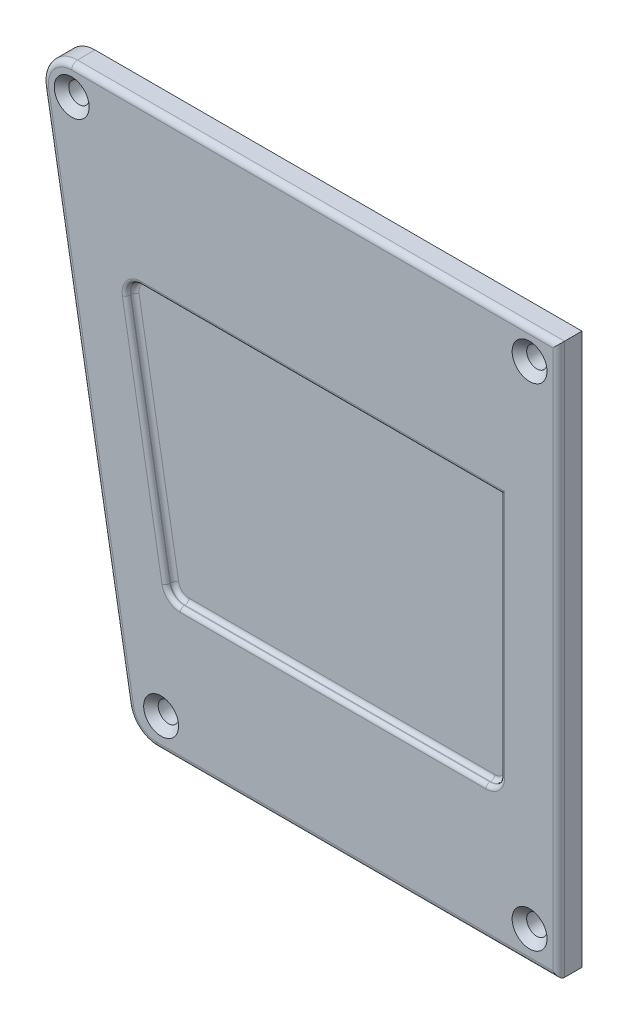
ISO-10303-21;
HEADER;
FILE_DESCRIPTION(('STEP AP214'),'2;1');
FILE_NAME('part.step','',(''),(''),'','','');
FILE_SCHEMA(('AUTOMOTIVE_DESIGN { 1 0 10303 214 1 1 1 1 }'));
ENDSEC;
DATA;
#1=APPLICATION_CONTEXT('core data for automotive mechanical design processes');
#2=APPLICATION_PROTOCOL_DEFINITION('international standard','automotive_design',2000,#1);
#3=PRODUCT_CONTEXT('',#1,'mechanical');
#4=PRODUCT('Part','Part','',(#3));
#5=PRODUCT_RELATED_PRODUCT_CATEGORY('part','',(#4));
#6=PRODUCT_DEFINITION_FORMATION('','',#4);
#7=PRODUCT_DEFINITION_CONTEXT('part definition',#1,'design');
#8=PRODUCT_DEFINITION('design','',#6,#7);
#9=PRODUCT_DEFINITION_SHAPE('','',#8);
#10=(LENGTH_UNIT() NAMED_UNIT(*) SI_UNIT(.MILLI.,.METRE.));
#11=(NAMED_UNIT(*) PLANE_ANGLE_UNIT() SI_UNIT($,.RADIAN.));
#12=(NAMED_UNIT(*) SI_UNIT($,.STERADIAN.) SOLID_ANGLE_UNIT());
#13=UNCERTAINTY_MEASURE_WITH_UNIT(LENGTH_MEASURE(1.E-05),#10,'distance_accuracy_value','');
#14=(GEOMETRIC_REPRESENTATION_CONTEXT(3) GLOBAL_UNCERTAINTY_ASSIGNED_CONTEXT((#13)) GLOBAL_UNIT_ASSIGNED_CONTEXT((#10,
#11,#12)) REPRESENTATION_CONTEXT('',''));
#15=CARTESIAN_POINT('',(0.,0.,0.));
#16=DIRECTION('',(0.,0.,1.));
#17=DIRECTION('',(1.,0.,0.));
#18=AXIS2_PLACEMENT_3D('',#15,#16,#17);
#19=CARTESIAN_POINT('',(-114.890913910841,7.99999999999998,8.));
#20=DIRECTION('',(0.,0.,-1.));
#21=DIRECTION('',(-1.,0.,0.));
#22=AXIS2_PLACEMENT_3D('',#19,#20,#21);
#23=PLANE('',#22);
#24=CARTESIAN_POINT('',(-113.316351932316,8.49,8.));
#25=DIRECTION('',(0.,0.,1.));
#26=DIRECTION('',(1.,0.,0.));
#27=AXIS2_PLACEMENT_3D('',#24,#25,#26);
#28=CIRCLE('',#27,6.);
#29=CARTESIAN_POINT('',(-107.316351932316,8.49,8.));
#30=VERTEX_POINT('',#29);
#31=EDGE_CURVE('E727',#30,#30,#28,.T.);
#32=ORIENTED_EDGE('',*,*,#31,.F.);
#33=EDGE_LOOP('',(#32));
#34=FACE_BOUND('',#33,.T.);
#35=CARTESIAN_POINT('',(13.3336480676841,8.49,8.));
#36=DIRECTION('',(0.,0.,1.));
#37=DIRECTION('',(1.,0.,0.));
#38=AXIS2_PLACEMENT_3D('',#35,#36,#37);
#39=CIRCLE('',#38,6.);
#40=CARTESIAN_POINT('',(19.3336480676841,8.49,8.));
#41=VERTEX_POINT('',#40);
#42=EDGE_CURVE('E713',#41,#41,#39,.T.);
#43=ORIENTED_EDGE('',*,*,#42,.F.);
#44=EDGE_LOOP('',(#43));
#45=FACE_BOUND('',#44,.T.);
#46=CARTESIAN_POINT('',(13.3336480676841,177.4,8.));
#47=DIRECTION('',(0.,0.,1.));
#48=DIRECTION('',(1.,0.,0.));
#49=AXIS2_PLACEMENT_3D('',#46,#47,#48);
#50=CIRCLE('',#49,6.);
#51=CARTESIAN_POINT('',(19.3336480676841,177.4,8.));
#52=VERTEX_POINT('',#51);
#53=EDGE_CURVE('E710',#52,#52,#50,.T.);
#54=ORIENTED_EDGE('',*,*,#53,.F.);
#55=EDGE_LOOP('',(#54));
#56=FACE_BOUND('',#55,.T.);
#57=CARTESIAN_POINT('',(-144.056351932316,177.4,8.));
#58=DIRECTION('',(0.,0.,1.));
#59=DIRECTION('',(1.,0.,0.));
#60=AXIS2_PLACEMENT_3D('',#57,#58,#59);
#61=CIRCLE('',#60,6.00000000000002);
#62=CARTESIAN_POINT('',(-138.056351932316,177.4,8.));
#63=VERTEX_POINT('',#62);
#64=EDGE_CURVE('E707',#63,#63,#61,.T.);
#65=ORIENTED_EDGE('',*,*,#64,.F.);
#66=EDGE_LOOP('',(#65));
#67=FACE_BOUND('',#66,.T.);
#68=CARTESIAN_POINT('',(-120.330507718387,128.,8.));
#69=DIRECTION('',(0.,0.,-1.));
#70=DIRECTION('',(-1.,0.,0.));
#71=AXIS2_PLACEMENT_3D('',#68,#69,#70);
#72=CIRCLE('',#71,6.39999999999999);
#73=CARTESIAN_POINT('',(-126.637710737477,126.91409481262,8.));
#74=VERTEX_POINT('',#73);
#75=CARTESIAN_POINT('',(-120.330507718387,134.4,8.));
#76=VERTEX_POINT('',#75);
#77=EDGE_CURVE('E595',#74,#76,#72,.T.);
#78=ORIENTED_EDGE('',*,*,#77,.T.);
#79=DIRECTION('',(-1.,0.,0.));
#80=VECTOR('',#79,1.);
#81=CARTESIAN_POINT('',(-114.890913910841,134.4,8.));
#82=LINE('',#81,#80);
#83=CARTESIAN_POINT('',(4.73364806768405,134.4,8.));
#84=VERTEX_POINT('',#83);
#85=EDGE_CURVE('E597',#76,#84,#82,.F.);
#86=ORIENTED_EDGE('',*,*,#85,.T.);
#87=DIRECTION('',(0.,1.,0.));
#88=VECTOR('',#87,1.);
#89=CARTESIAN_POINT('',(4.73364806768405,7.99999999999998,8.));
#90=LINE('',#89,#88);
#91=CARTESIAN_POINT('',(4.73364806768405,49.,8.));
#92=VERTEX_POINT('',#91);
#93=EDGE_CURVE('E593',#84,#92,#90,.F.);
#94=ORIENTED_EDGE('',*,*,#93,.T.);
#95=CARTESIAN_POINT('',(-1.66635193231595,49.,8.));
#96=DIRECTION('',(0.,0.,-1.));
#97=DIRECTION('',(-1.,0.,0.));
#98=AXIS2_PLACEMENT_3D('',#95,#96,#97);
#99=CIRCLE('',#98,6.4);
#100=CARTESIAN_POINT('',(-1.666351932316,42.6,8.));
#101=VERTEX_POINT('',#100);
#102=EDGE_CURVE('E591',#92,#101,#99,.T.);
#103=ORIENTED_EDGE('',*,*,#102,.T.);
#104=DIRECTION('',(1.,0.,0.));
#105=VECTOR('',#104,1.);
#106=CARTESIAN_POINT('',(-114.890913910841,42.6,8.));
#107=LINE('',#106,#105);
#108=CARTESIAN_POINT('',(-106.729152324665,42.6,8.));
#109=VERTEX_POINT('',#108);
#110=EDGE_CURVE('E589',#101,#109,#107,.F.);
#111=ORIENTED_EDGE('',*,*,#110,.T.);
#112=CARTESIAN_POINT('',(-106.729152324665,49.,8.));
#113=DIRECTION('',(0.,0.,-1.));
#114=DIRECTION('',(-1.,0.,0.));
#115=AXIS2_PLACEMENT_3D('',#112,#113,#114);
#116=CIRCLE('',#115,6.4);
#117=CARTESIAN_POINT('',(-113.036355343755,47.9140948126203,8.));
#118=VERTEX_POINT('',#117);
#119=EDGE_CURVE('E587',#109,#118,#116,.T.);
#120=ORIENTED_EDGE('',*,*,#119,.T.);
#121=DIRECTION('',(0.169672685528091,-0.985500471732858,0.));
#122=VECTOR('',#121,1.);
#123=CARTESIAN_POINT('',(-106.415609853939,9.45918509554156,8.));
#124=LINE('',#123,#122);
#125=EDGE_CURVE('E585',#118,#74,#124,.F.);
#126=ORIENTED_EDGE('',*,*,#125,.T.);
#127=EDGE_LOOP('',(#78,#86,#94,#103,#111,#120,#126));
#128=FACE_BOUND('',#127,.T.);
#129=CARTESIAN_POINT('',(-114.890913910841,7.99999999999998,8.));
#130=DIRECTION('',(0.,0.,-1.));
#131=DIRECTION('',(-1.,0.,0.));
#132=AXIS2_PLACEMENT_3D('',#129,#130,#131);
#133=CIRCLE('',#132,8.);
#134=CARTESIAN_POINT('',(-122.774917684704,6.6426185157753,8.));
#135=VERTEX_POINT('',#134);
#136=CARTESIAN_POINT('',(-114.890913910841,0.,8.));
#137=VERTEX_POINT('',#136);
#138=EDGE_CURVE('E561',#135,#137,#133,.F.);
#139=ORIENTED_EDGE('',*,*,#138,.T.);
#140=DIRECTION('',(1.,0.,0.));
#141=VECTOR('',#140,1.);
#142=CARTESIAN_POINT('',(-114.890913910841,0.,8.));
#143=LINE('',#142,#141);
#144=CARTESIAN_POINT('',(21.3336480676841,0.,8.));
#145=VERTEX_POINT('',#144);
#146=EDGE_CURVE('E563',#137,#145,#143,.T.);
#147=ORIENTED_EDGE('',*,*,#146,.T.);
#148=DIRECTION('',(0.,1.,0.));
#149=VECTOR('',#148,1.);
#150=CARTESIAN_POINT('',(21.3336480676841,8.00000000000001,8.));
#151=LINE('',#150,#149);
#152=CARTESIAN_POINT('',(21.3336480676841,185.4,8.));
#153=VERTEX_POINT('',#152);
#154=EDGE_CURVE('E554',#145,#153,#151,.T.);
#155=ORIENTED_EDGE('',*,*,#154,.T.);
#156=DIRECTION('',(-1.,0.,0.));
#157=VECTOR('',#156,1.);
#158=CARTESIAN_POINT('',(-114.890913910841,185.4,8.));
#159=LINE('',#158,#157);
#160=CARTESIAN_POINT('',(-144.056351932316,185.4,8.));
#161=VERTEX_POINT('',#160);
#162=EDGE_CURVE('E551',#153,#161,#159,.T.);
#163=ORIENTED_EDGE('',*,*,#162,.T.);
#164=CARTESIAN_POINT('',(-144.056351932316,177.4,8.));
#165=DIRECTION('',(0.,0.,-1.));
#166=DIRECTION('',(-1.,0.,0.));
#167=AXIS2_PLACEMENT_3D('',#164,#165,#166);
#168=CIRCLE('',#167,8.00000000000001);
#169=CARTESIAN_POINT('',(-151.940355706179,176.042618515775,8.));
#170=VERTEX_POINT('',#169);
#171=EDGE_CURVE('E557',#161,#170,#168,.F.);
#172=ORIENTED_EDGE('',*,*,#171,.T.);
#173=DIRECTION('',(0.169672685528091,-0.985500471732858,0.));
#174=VECTOR('',#173,1.);
#175=CARTESIAN_POINT('',(-122.774917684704,6.64261851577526,8.));
#176=LINE('',#175,#174);
#177=EDGE_CURVE('E559',#170,#135,#176,.T.);
#178=ORIENTED_EDGE('',*,*,#177,.T.);
#179=EDGE_LOOP('',(#139,#147,#155,#163,#172,#178));
#180=FACE_BOUND('',#179,.T.);
#181=ADVANCED_FACE('F37',(#34,#45,#56,#67,#128,#180),#23,.F.);
#182=CARTESIAN_POINT('',(-114.890913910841,7.99999999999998,0.));
#183=DIRECTION('',(0.,0.,-1.));
#184=DIRECTION('',(-1.,0.,0.));
#185=AXIS2_PLACEMENT_3D('',#182,#183,#184);
#186=PLANE('',#185);
#187=CARTESIAN_POINT('',(-96.9518221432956,32.,0.));
#188=DIRECTION('',(0.,0.,-1.));
#189=DIRECTION('',(1.,0.,0.));
#190=AXIS2_PLACEMENT_3D('',#187,#188,#189);
#191=CIRCLE('',#190,5.);
#192=CARTESIAN_POINT('',(-101.951822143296,32.,0.));
#193=VERTEX_POINT('',#192);
#194=CARTESIAN_POINT('',(-96.9518221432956,37.,0.));
#195=VERTEX_POINT('',#194);
#196=EDGE_CURVE('E358',#193,#195,#191,.T.);
#197=ORIENTED_EDGE('',*,*,#196,.F.);
#198=DIRECTION('',(0.,1.,0.));
#199=VECTOR('',#198,1.);
#200=CARTESIAN_POINT('',(-101.951822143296,32.,0.));
#201=LINE('',#200,#199);
#202=CARTESIAN_POINT('',(-101.951822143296,14.4331418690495,0.));
#203=VERTEX_POINT('',#202);
#204=EDGE_CURVE('E378',#203,#193,#201,.T.);
#205=ORIENTED_EDGE('',*,*,#204,.F.);
#206=CARTESIAN_POINT('',(-96.9518221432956,14.4331418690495,0.));
#207=DIRECTION('',(0.,0.,-1.));
#208=DIRECTION('',(1.,0.,0.));
#209=AXIS2_PLACEMENT_3D('',#206,#207,#208);
#210=CIRCLE('',#209,5.);
#211=CARTESIAN_POINT('',(-96.9518221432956,9.43314186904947,0.));
#212=VERTEX_POINT('',#211);
#213=EDGE_CURVE('E375',#212,#203,#210,.T.);
#214=ORIENTED_EDGE('',*,*,#213,.F.);
#215=DIRECTION('',(-1.,0.,0.));
#216=VECTOR('',#215,1.);
#217=CARTESIAN_POINT('',(-1.66635193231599,9.43314186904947,0.));
#218=LINE('',#217,#216);
#219=CARTESIAN_POINT('',(-1.66635193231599,9.43314186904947,0.));
#220=VERTEX_POINT('',#219);
#221=EDGE_CURVE('E372',#220,#212,#218,.T.);
#222=ORIENTED_EDGE('',*,*,#221,.F.);
#223=CARTESIAN_POINT('',(-1.66635193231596,14.4331418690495,0.));
#224=DIRECTION('',(0.,0.,-1.));
#225=DIRECTION('',(1.,0.,0.));
#226=AXIS2_PLACEMENT_3D('',#223,#224,#225);
#227=CIRCLE('',#226,5.);
#228=CARTESIAN_POINT('',(3.33364806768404,14.4331418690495,0.));
#229=VERTEX_POINT('',#228);
#230=EDGE_CURVE('E366',#229,#220,#227,.T.);
#231=ORIENTED_EDGE('',*,*,#230,.F.);
#232=DIRECTION('',(0.,-1.,0.));
#233=VECTOR('',#232,1.);
#234=CARTESIAN_POINT('',(3.33364806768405,32.,0.));
#235=LINE('',#234,#233);
#236=CARTESIAN_POINT('',(3.33364806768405,32.,0.));
#237=VERTEX_POINT('',#236);
#238=EDGE_CURVE('E364',#237,#229,#235,.T.);
#239=ORIENTED_EDGE('',*,*,#238,.F.);
#240=CARTESIAN_POINT('',(-1.66635193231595,32.,0.));
#241=DIRECTION('',(0.,0.,-1.));
#242=DIRECTION('',(1.,0.,0.));
#243=AXIS2_PLACEMENT_3D('',#240,#241,#242);
#244=CIRCLE('',#243,5.);
#245=CARTESIAN_POINT('',(-1.66635193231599,37.,0.));
#246=VERTEX_POINT('',#245);
#247=EDGE_CURVE('E342',#246,#237,#244,.T.);
#248=ORIENTED_EDGE('',*,*,#247,.F.);
#249=DIRECTION('',(1.,0.,0.));
#250=VECTOR('',#249,1.);
#251=CARTESIAN_POINT('',(-1.66635193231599,37.,0.));
#252=LINE('',#251,#250);
#253=EDGE_CURVE('E352',#195,#246,#252,.T.);
#254=ORIENTED_EDGE('',*,*,#253,.F.);
#255=EDGE_LOOP('',(#197,#205,#214,#222,#231,#239,#248,#254));
#256=FACE_BOUND('',#255,.T.);
#257=CARTESIAN_POINT('',(-121.524693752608,162.548258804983,0.));
#258=DIRECTION('',(0.,0.,-1.));
#259=DIRECTION('',(1.,0.,0.));
#260=AXIS2_PLACEMENT_3D('',#257,#258,#259);
#261=CIRCLE('',#260,5.);
#262=CARTESIAN_POINT('',(-126.524693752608,162.548258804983,0.));
#263=VERTEX_POINT('',#262);
#264=CARTESIAN_POINT('',(-121.524693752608,167.548258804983,0.));
#265=VERTEX_POINT('',#264);
#266=EDGE_CURVE('E383',#263,#265,#261,.T.);
#267=ORIENTED_EDGE('',*,*,#266,.F.);
#268=DIRECTION('',(0.,1.,0.));
#269=VECTOR('',#268,1.);
#270=CARTESIAN_POINT('',(-126.524693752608,162.548258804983,0.));
#271=LINE('',#270,#269);
#272=CARTESIAN_POINT('',(-126.524693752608,145.,0.));
#273=VERTEX_POINT('',#272);
#274=EDGE_CURVE('E414',#273,#263,#271,.T.);
#275=ORIENTED_EDGE('',*,*,#274,.F.);
#276=CARTESIAN_POINT('',(-121.524693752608,145.,0.));
#277=DIRECTION('',(0.,0.,-1.));
#278=DIRECTION('',(1.,0.,0.));
#279=AXIS2_PLACEMENT_3D('',#276,#277,#278);
#280=CIRCLE('',#279,5.);
#281=CARTESIAN_POINT('',(-121.524693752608,140.,0.));
#282=VERTEX_POINT('',#281);
#283=EDGE_CURVE('E411',#282,#273,#280,.T.);
#284=ORIENTED_EDGE('',*,*,#283,.F.);
#285=DIRECTION('',(-1.,0.,0.));
#286=VECTOR('',#285,1.);
#287=CARTESIAN_POINT('',(-1.66635193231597,140.,0.));
#288=LINE('',#287,#286);
#289=CARTESIAN_POINT('',(-1.66635193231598,140.,0.));
#290=VERTEX_POINT('',#289);
#291=EDGE_CURVE('E408',#290,#282,#288,.T.);
#292=ORIENTED_EDGE('',*,*,#291,.F.);
#293=CARTESIAN_POINT('',(-1.66635193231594,145.,0.));
#294=DIRECTION('',(0.,0.,-1.));
#295=DIRECTION('',(1.,0.,0.));
#296=AXIS2_PLACEMENT_3D('',#293,#294,#295);
#297=CIRCLE('',#296,5.);
#298=CARTESIAN_POINT('',(3.33364806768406,145.,0.));
#299=VERTEX_POINT('',#298);
#300=EDGE_CURVE('E405',#299,#290,#297,.T.);
#301=ORIENTED_EDGE('',*,*,#300,.F.);
#302=DIRECTION('',(0.,-1.,0.));
#303=VECTOR('',#302,1.);
#304=CARTESIAN_POINT('',(3.33364806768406,162.548258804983,0.));
#305=LINE('',#304,#303);
#306=CARTESIAN_POINT('',(3.33364806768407,162.548258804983,0.));
#307=VERTEX_POINT('',#306);
#308=EDGE_CURVE('E402',#307,#299,#305,.T.);
#309=ORIENTED_EDGE('',*,*,#308,.F.);
#310=CARTESIAN_POINT('',(-1.66635193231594,162.548258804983,0.));
#311=DIRECTION('',(0.,0.,-1.));
#312=DIRECTION('',(1.,0.,0.));
#313=AXIS2_PLACEMENT_3D('',#310,#311,#312);
#314=CIRCLE('',#313,5.);
#315=CARTESIAN_POINT('',(-1.66635193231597,167.548258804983,0.));
#316=VERTEX_POINT('',#315);
#317=EDGE_CURVE('E399',#316,#307,#314,.T.);
#318=ORIENTED_EDGE('',*,*,#317,.F.);
#319=DIRECTION('',(1.,0.,0.));
#320=VECTOR('',#319,1.);
#321=CARTESIAN_POINT('',(-1.66635193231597,167.548258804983,0.));
#322=LINE('',#321,#320);
#323=EDGE_CURVE('E396',#265,#316,#322,.T.);
#324=ORIENTED_EDGE('',*,*,#323,.F.);
#325=EDGE_LOOP('',(#267,#275,#284,#292,#301,#309,#318,#324));
#326=FACE_BOUND('',#325,.T.);
#327=CARTESIAN_POINT('',(13.3336480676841,8.49,0.));
#328=DIRECTION('',(0.,0.,1.));
#329=DIRECTION('',(1.,0.,0.));
#330=AXIS2_PLACEMENT_3D('',#327,#328,#329);
#331=CIRCLE('',#330,3.5);
#332=CARTESIAN_POINT('',(16.8336480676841,8.49,0.));
#333=VERTEX_POINT('',#332);
#334=EDGE_CURVE('E511',#333,#333,#331,.T.);
#335=ORIENTED_EDGE('',*,*,#334,.T.);
#336=EDGE_LOOP('',(#335));
#337=FACE_BOUND('',#336,.T.);
#338=CARTESIAN_POINT('',(-144.056351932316,177.4,0.));
#339=DIRECTION('',(0.,0.,1.));
#340=DIRECTION('',(1.,0.,0.));
#341=AXIS2_PLACEMENT_3D('',#338,#339,#340);
#342=CIRCLE('',#341,3.49999999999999);
#343=CARTESIAN_POINT('',(-140.556351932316,177.4,0.));
#344=VERTEX_POINT('',#343);
#345=EDGE_CURVE('E517',#344,#344,#342,.T.);
#346=ORIENTED_EDGE('',*,*,#345,.T.);
#347=EDGE_LOOP('',(#346));
#348=FACE_BOUND('',#347,.T.);
#349=DIRECTION('',(0.,1.,0.));
#350=VECTOR('',#349,1.);
#351=CARTESIAN_POINT('',(23.333648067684,187.4,0.));
#352=LINE('',#351,#350);
#353=CARTESIAN_POINT('',(23.3336480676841,-2.,0.));
#354=VERTEX_POINT('',#353);
#355=CARTESIAN_POINT('',(23.333648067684,187.4,0.));
#356=VERTEX_POINT('',#355);
#357=EDGE_CURVE('E520',#354,#356,#352,.T.);
#358=ORIENTED_EDGE('',*,*,#357,.F.);
#359=DIRECTION('',(1.,0.,0.));
#360=VECTOR('',#359,1.);
#361=CARTESIAN_POINT('',(23.3336480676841,-2.,0.));
#362=LINE('',#361,#360);
#363=CARTESIAN_POINT('',(-114.890913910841,-2.00000000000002,0.));
#364=VERTEX_POINT('',#363);
#365=EDGE_CURVE('E536',#364,#354,#362,.T.);
#366=ORIENTED_EDGE('',*,*,#365,.F.);
#367=CARTESIAN_POINT('',(-114.890913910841,7.99999999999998,0.));
#368=DIRECTION('',(0.,0.,1.));
#369=DIRECTION('',(-1.,0.,0.));
#370=AXIS2_PLACEMENT_3D('',#367,#368,#369);
#371=CIRCLE('',#370,10.);
#372=CARTESIAN_POINT('',(-124.74591862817,6.30327314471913,0.));
#373=VERTEX_POINT('',#372);
#374=EDGE_CURVE('E533',#373,#364,#371,.T.);
#375=ORIENTED_EDGE('',*,*,#374,.F.);
#376=DIRECTION('',(0.169672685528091,-0.985500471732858,0.));
#377=VECTOR('',#376,1.);
#378=CARTESIAN_POINT('',(-124.74591862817,6.30327314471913,0.));
#379=LINE('',#378,#377);
#380=CARTESIAN_POINT('',(-153.911356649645,175.703273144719,0.));
#381=VERTEX_POINT('',#380);
#382=EDGE_CURVE('E529',#381,#373,#379,.T.);
#383=ORIENTED_EDGE('',*,*,#382,.F.);
#384=CARTESIAN_POINT('',(-144.056351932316,177.4,0.));
#385=DIRECTION('',(0.,0.,1.));
#386=DIRECTION('',(1.,0.,0.));
#387=AXIS2_PLACEMENT_3D('',#384,#385,#386);
#388=CIRCLE('',#387,10.);
#389=CARTESIAN_POINT('',(-144.056351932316,187.4,0.));
#390=VERTEX_POINT('',#389);
#391=EDGE_CURVE('E526',#390,#381,#388,.T.);
#392=ORIENTED_EDGE('',*,*,#391,.F.);
#393=DIRECTION('',(-1.,0.,0.));
#394=VECTOR('',#393,1.);
#395=CARTESIAN_POINT('',(-144.056351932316,187.4,0.));
#396=LINE('',#395,#394);
#397=EDGE_CURVE('E523',#356,#390,#396,.T.);
#398=ORIENTED_EDGE('',*,*,#397,.F.);
#399=EDGE_LOOP('',(#358,#366,#375,#383,#392,#398));
#400=FACE_BOUND('',#399,.T.);
#401=CARTESIAN_POINT('',(13.3336480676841,177.4,0.));
#402=DIRECTION('',(0.,0.,1.));
#403=DIRECTION('',(1.,0.,0.));
#404=AXIS2_PLACEMENT_3D('',#401,#402,#403);
#405=CIRCLE('',#404,3.5);
#406=CARTESIAN_POINT('',(16.8336480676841,177.4,0.));
#407=VERTEX_POINT('',#406);
#408=EDGE_CURVE('E514',#407,#407,#405,.T.);
#409=ORIENTED_EDGE('',*,*,#408,.T.);
#410=EDGE_LOOP('',(#409));
#411=FACE_BOUND('',#410,.T.);
#412=CARTESIAN_POINT('',(-113.316351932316,8.49,0.));
#413=DIRECTION('',(0.,0.,1.));
#414=DIRECTION('',(1.,0.,0.));
#415=AXIS2_PLACEMENT_3D('',#412,#413,#414);
#416=CIRCLE('',#415,3.50000000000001);
#417=CARTESIAN_POINT('',(-109.816351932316,8.49,0.));
#418=VERTEX_POINT('',#417);
#419=EDGE_CURVE('E508',#418,#418,#416,.T.);
#420=ORIENTED_EDGE('',*,*,#419,.T.);
#421=EDGE_LOOP('',(#420));
#422=FACE_BOUND('',#421,.T.);
#423=ADVANCED_FACE('F360',(#256,#326,#337,#348,#400,#411,#422),#186,.T.);
#424=CARTESIAN_POINT('',(23.333648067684,187.4,8.));
#425=DIRECTION('',(-1.,0.,0.));
#426=DIRECTION('',(0.,-1.,0.));
#427=AXIS2_PLACEMENT_3D('',#424,#425,#426);
#428=PLANE('',#427);
#429=DIRECTION('',(0.,0.,-1.));
#430=VECTOR('',#429,1.);
#431=CARTESIAN_POINT('',(23.333648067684,187.4,8.));
#432=LINE('',#431,#430);
#433=CARTESIAN_POINT('',(23.333648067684,187.4,6.));
#434=VERTEX_POINT('',#433);
#435=EDGE_CURVE('E549',#434,#356,#432,.T.);
#436=ORIENTED_EDGE('',*,*,#435,.F.);
#437=DIRECTION('',(0.,1.,0.));
#438=VECTOR('',#437,1.);
#439=CARTESIAN_POINT('',(23.333648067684,187.4,6.));
#440=LINE('',#439,#438);
#441=CARTESIAN_POINT('',(23.3336480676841,-2.,6.));
#442=VERTEX_POINT('',#441);
#443=EDGE_CURVE('E576',#434,#442,#440,.F.);
#444=ORIENTED_EDGE('',*,*,#443,.T.);
#445=DIRECTION('',(0.,0.,-1.));
#446=VECTOR('',#445,1.);
#447=CARTESIAN_POINT('',(23.3336480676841,-2.,8.));
#448=LINE('',#447,#446);
#449=EDGE_CURVE('E539',#442,#354,#448,.T.);
#450=ORIENTED_EDGE('',*,*,#449,.T.);
#451=ORIENTED_EDGE('',*,*,#357,.T.);
#452=EDGE_LOOP('',(#436,#444,#450,#451));
#453=FACE_BOUND('',#452,.T.);
#454=ADVANCED_FACE('F39',(#453),#428,.F.);
#455=CARTESIAN_POINT('',(-144.056351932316,187.4,8.));
#456=DIRECTION('',(0.,-1.,0.));
#457=DIRECTION('',(0.,0.,-1.));
#458=AXIS2_PLACEMENT_3D('',#455,#456,#457);
#459=PLANE('',#458);
#460=DIRECTION('',(0.,0.,-1.));
#461=VECTOR('',#460,1.);
#462=CARTESIAN_POINT('',(-144.056351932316,187.4,8.));
#463=LINE('',#462,#461);
#464=CARTESIAN_POINT('',(-144.056351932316,187.4,6.));
#465=VERTEX_POINT('',#464);
#466=EDGE_CURVE('E547',#465,#390,#463,.T.);
#467=ORIENTED_EDGE('',*,*,#466,.F.);
#468=DIRECTION('',(-1.,0.,0.));
#469=VECTOR('',#468,1.);
#470=CARTESIAN_POINT('',(-144.056351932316,187.4,6.));
#471=LINE('',#470,#469);
#472=EDGE_CURVE('E578',#465,#434,#471,.F.);
#473=ORIENTED_EDGE('',*,*,#472,.T.);
#474=ORIENTED_EDGE('',*,*,#435,.T.);
#475=ORIENTED_EDGE('',*,*,#397,.T.);
#476=EDGE_LOOP('',(#467,#473,#474,#475));
#477=FACE_BOUND('',#476,.T.);
#478=ADVANCED_FACE('F869',(#477),#459,.F.);
#479=CARTESIAN_POINT('',(-144.056351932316,177.4,8.));
#480=DIRECTION('',(0.,0.,-1.));
#481=DIRECTION('',(-1.,0.,0.));
#482=AXIS2_PLACEMENT_3D('',#479,#480,#481);
#483=CYLINDRICAL_SURFACE('',#482,10.);
#484=DIRECTION('',(0.,0.,-1.));
#485=VECTOR('',#484,1.);
#486=CARTESIAN_POINT('',(-153.911356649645,175.703273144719,8.));
#487=LINE('',#486,#485);
#488=CARTESIAN_POINT('',(-153.911356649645,175.703273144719,6.));
#489=VERTEX_POINT('',#488);
#490=EDGE_CURVE('E545',#489,#381,#487,.T.);
#491=ORIENTED_EDGE('',*,*,#490,.F.);
#492=CARTESIAN_POINT('',(-144.056351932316,177.4,6.));
#493=DIRECTION('',(0.,0.,-1.));
#494=DIRECTION('',(-1.,0.,0.));
#495=AXIS2_PLACEMENT_3D('',#492,#493,#494);
#496=CIRCLE('',#495,10.);
#497=EDGE_CURVE('E574',#489,#465,#496,.T.);
#498=ORIENTED_EDGE('',*,*,#497,.T.);
#499=ORIENTED_EDGE('',*,*,#466,.T.);
#500=ORIENTED_EDGE('',*,*,#391,.T.);
#501=EDGE_LOOP('',(#491,#498,#499,#500));
#502=FACE_BOUND('',#501,.T.);
#503=ADVANCED_FACE('F866',(#502),#483,.T.);
#504=CARTESIAN_POINT('',(-124.74591862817,6.30327314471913,8.));
#505=DIRECTION('',(0.985500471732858,0.169672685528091,0.));
#506=DIRECTION('',(-0.169672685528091,0.985500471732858,0.));
#507=AXIS2_PLACEMENT_3D('',#504,#505,#506);
#508=PLANE('',#507);
#509=DIRECTION('',(0.,0.,-1.));
#510=VECTOR('',#509,1.);
#511=CARTESIAN_POINT('',(-124.74591862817,6.30327314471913,8.));
#512=LINE('',#511,#510);
#513=CARTESIAN_POINT('',(-124.74591862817,6.30327314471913,6.));
#514=VERTEX_POINT('',#513);
#515=EDGE_CURVE('E543',#514,#373,#512,.T.);
#516=ORIENTED_EDGE('',*,*,#515,.F.);
#517=DIRECTION('',(0.169672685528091,-0.985500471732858,0.));
#518=VECTOR('',#517,1.);
#519=CARTESIAN_POINT('',(-124.74591862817,6.30327314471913,6.));
#520=LINE('',#519,#518);
#521=EDGE_CURVE('E572',#514,#489,#520,.F.);
#522=ORIENTED_EDGE('',*,*,#521,.T.);
#523=ORIENTED_EDGE('',*,*,#490,.T.);
#524=ORIENTED_EDGE('',*,*,#382,.T.);
#525=EDGE_LOOP('',(#516,#522,#523,#524));
#526=FACE_BOUND('',#525,.T.);
#527=ADVANCED_FACE('F862',(#526),#508,.F.);
#528=CARTESIAN_POINT('',(-114.890913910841,7.99999999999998,8.));
#529=DIRECTION('',(0.,0.,-1.));
#530=DIRECTION('',(-1.,0.,0.));
#531=AXIS2_PLACEMENT_3D('',#528,#529,#530);
#532=CYLINDRICAL_SURFACE('',#531,10.);
#533=DIRECTION('',(0.,0.,-1.));
#534=VECTOR('',#533,1.);
#535=CARTESIAN_POINT('',(-114.890913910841,-2.00000000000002,8.));
#536=LINE('',#535,#534);
#537=CARTESIAN_POINT('',(-114.890913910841,-2.00000000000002,6.));
#538=VERTEX_POINT('',#537);
#539=EDGE_CURVE('E541',#538,#364,#536,.T.);
#540=ORIENTED_EDGE('',*,*,#539,.F.);
#541=CARTESIAN_POINT('',(-114.890913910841,7.99999999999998,6.));
#542=DIRECTION('',(0.,0.,-1.));
#543=DIRECTION('',(-1.,0.,0.));
#544=AXIS2_PLACEMENT_3D('',#541,#542,#543);
#545=CIRCLE('',#544,10.);
#546=EDGE_CURVE('E570',#538,#514,#545,.T.);
#547=ORIENTED_EDGE('',*,*,#546,.T.);
#548=ORIENTED_EDGE('',*,*,#515,.T.);
#549=ORIENTED_EDGE('',*,*,#374,.T.);
#550=EDGE_LOOP('',(#540,#547,#548,#549));
#551=FACE_BOUND('',#550,.T.);
#552=ADVANCED_FACE('F858',(#551),#532,.T.);
#553=CARTESIAN_POINT('',(23.3336480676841,-2.,8.));
#554=DIRECTION('',(0.,1.,0.));
#555=DIRECTION('',(-1.,0.,0.));
#556=AXIS2_PLACEMENT_3D('',#553,#554,#555);
#557=PLANE('',#556);
#558=ORIENTED_EDGE('',*,*,#449,.F.);
#559=DIRECTION('',(1.,0.,0.));
#560=VECTOR('',#559,1.);
#561=CARTESIAN_POINT('',(23.3336480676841,-2.,6.));
#562=LINE('',#561,#560);
#563=EDGE_CURVE('E567',#442,#538,#562,.F.);
#564=ORIENTED_EDGE('',*,*,#563,.T.);
#565=ORIENTED_EDGE('',*,*,#539,.T.);
#566=ORIENTED_EDGE('',*,*,#365,.T.);
#567=EDGE_LOOP('',(#558,#564,#565,#566));
#568=FACE_BOUND('',#567,.T.);
#569=ADVANCED_FACE('F854',(#568),#557,.F.);
#570=CARTESIAN_POINT('',(-144.056351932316,177.4,8.));
#571=DIRECTION('',(0.,0.,-1.));
#572=DIRECTION('',(-1.,0.,0.));
#573=AXIS2_PLACEMENT_3D('',#570,#571,#572);
#574=CYLINDRICAL_SURFACE('',#573,3.49999999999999);
#575=CARTESIAN_POINT('',(-144.056351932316,177.4,5.49999999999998));
#576=DIRECTION('',(0.,0.,1.));
#577=DIRECTION('',(1.,0.,0.));
#578=AXIS2_PLACEMENT_3D('',#575,#576,#577);
#579=CIRCLE('',#578,3.49999999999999);
#580=CARTESIAN_POINT('',(-140.556351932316,177.4,5.49999999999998));
#581=VERTEX_POINT('',#580);
#582=EDGE_CURVE('E703',#581,#581,#579,.F.);
#583=ORIENTED_EDGE('',*,*,#582,.F.);
#584=EDGE_LOOP('',(#583));
#585=FACE_BOUND('',#584,.T.);
#586=ORIENTED_EDGE('',*,*,#345,.F.);
#587=EDGE_LOOP('',(#586));
#588=FACE_BOUND('',#587,.T.);
#589=ADVANCED_FACE('F857',(#585,#588),#574,.F.);
#590=CARTESIAN_POINT('',(13.3336480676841,177.4,8.));
#591=DIRECTION('',(0.,0.,-1.));
#592=DIRECTION('',(-1.,0.,0.));
#593=AXIS2_PLACEMENT_3D('',#590,#591,#592);
#594=CYLINDRICAL_SURFACE('',#593,3.5);
#595=CARTESIAN_POINT('',(13.3336480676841,177.4,5.50000000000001));
#596=DIRECTION('',(0.,0.,1.));
#597=DIRECTION('',(1.,0.,0.));
#598=AXIS2_PLACEMENT_3D('',#595,#596,#597);
#599=CIRCLE('',#598,3.5);
#600=CARTESIAN_POINT('',(16.8336480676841,177.4,5.50000000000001));
#601=VERTEX_POINT('',#600);
#602=EDGE_CURVE('E708',#601,#601,#599,.F.);
#603=ORIENTED_EDGE('',*,*,#602,.F.);
#604=EDGE_LOOP('',(#603));
#605=FACE_BOUND('',#604,.T.);
#606=ORIENTED_EDGE('',*,*,#408,.F.);
#607=EDGE_LOOP('',(#606));
#608=FACE_BOUND('',#607,.T.);
#609=ADVANCED_FACE('F937',(#605,#608),#594,.F.);
#610=CARTESIAN_POINT('',(13.3336480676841,8.49,8.));
#611=DIRECTION('',(0.,0.,-1.));
#612=DIRECTION('',(-1.,0.,0.));
#613=AXIS2_PLACEMENT_3D('',#610,#611,#612);
#614=CYLINDRICAL_SURFACE('',#613,3.5);
#615=CARTESIAN_POINT('',(13.3336480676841,8.49,5.50000000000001));
#616=DIRECTION('',(0.,0.,1.));
#617=DIRECTION('',(1.,0.,0.));
#618=AXIS2_PLACEMENT_3D('',#615,#616,#617);
#619=CIRCLE('',#618,3.5);
#620=CARTESIAN_POINT('',(16.8336480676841,8.49,5.50000000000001));
#621=VERTEX_POINT('',#620);
#622=EDGE_CURVE('E711',#621,#621,#619,.F.);
#623=ORIENTED_EDGE('',*,*,#622,.F.);
#624=EDGE_LOOP('',(#623));
#625=FACE_BOUND('',#624,.T.);
#626=ORIENTED_EDGE('',*,*,#334,.F.);
#627=EDGE_LOOP('',(#626));
#628=FACE_BOUND('',#627,.T.);
#629=ADVANCED_FACE('F933',(#625,#628),#614,.F.);
#630=CARTESIAN_POINT('',(-113.316351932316,8.49,8.));
#631=DIRECTION('',(0.,0.,-1.));
#632=DIRECTION('',(-1.,0.,0.));
#633=AXIS2_PLACEMENT_3D('',#630,#631,#632);
#634=CYLINDRICAL_SURFACE('',#633,3.50000000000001);
#635=CARTESIAN_POINT('',(-113.316351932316,8.49,5.50000000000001));
#636=DIRECTION('',(0.,0.,1.));
#637=DIRECTION('',(1.,0.,0.));
#638=AXIS2_PLACEMENT_3D('',#635,#636,#637);
#639=CIRCLE('',#638,3.50000000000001);
#640=CARTESIAN_POINT('',(-109.816351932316,8.49,5.50000000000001));
#641=VERTEX_POINT('',#640);
#642=EDGE_CURVE('E41',#641,#641,#639,.F.);
#643=ORIENTED_EDGE('',*,*,#642,.F.);
#644=EDGE_LOOP('',(#643));
#645=FACE_BOUND('',#644,.T.);
#646=ORIENTED_EDGE('',*,*,#419,.F.);
#647=EDGE_LOOP('',(#646));
#648=FACE_BOUND('',#647,.T.);
#649=ADVANCED_FACE('F927',(#645,#648),#634,.F.);
#650=CARTESIAN_POINT('',(-144.056351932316,177.4,6.));
#651=DIRECTION('',(0.,0.,-1.));
#652=DIRECTION('',(-1.,0.,0.));
#653=AXIS2_PLACEMENT_3D('',#650,#651,#652);
#654=TOROIDAL_SURFACE('',#653,8.00000000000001,2.);
#655=CARTESIAN_POINT('',(-144.056351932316,185.4,6.));
#656=DIRECTION('',(1.,0.,0.));
#657=DIRECTION('',(0.,0.,-1.));
#658=AXIS2_PLACEMENT_3D('',#655,#656,#657);
#659=CIRCLE('',#658,2.);
#660=EDGE_CURVE('E502',#465,#161,#659,.T.);
#661=ORIENTED_EDGE('',*,*,#660,.F.);
#662=ORIENTED_EDGE('',*,*,#497,.F.);
#663=CARTESIAN_POINT('',(-151.940355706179,176.042618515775,6.));
#664=DIRECTION('',(0.169672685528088,-0.985500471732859,0.));
#665=DIRECTION('',(0.985500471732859,0.169672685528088,0.));
#666=AXIS2_PLACEMENT_3D('',#663,#664,#665);
#667=CIRCLE('',#666,2.);
#668=EDGE_CURVE('E505',#170,#489,#667,.T.);
#669=ORIENTED_EDGE('',*,*,#668,.F.);
#670=ORIENTED_EDGE('',*,*,#171,.F.);
#671=EDGE_LOOP('',(#661,#662,#669,#670));
#672=FACE_BOUND('',#671,.T.);
#673=ADVANCED_FACE('F886',(#672),#654,.T.);
#674=CARTESIAN_POINT('',(-122.774917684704,6.64261851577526,6.));
#675=DIRECTION('',(0.169672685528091,-0.985500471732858,0.));
#676=DIRECTION('',(0.985500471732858,0.169672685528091,0.));
#677=AXIS2_PLACEMENT_3D('',#674,#675,#676);
#678=CYLINDRICAL_SURFACE('',#677,2.);
#679=ORIENTED_EDGE('',*,*,#668,.T.);
#680=ORIENTED_EDGE('',*,*,#521,.F.);
#681=CARTESIAN_POINT('',(-122.774917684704,6.6426185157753,6.));
#682=DIRECTION('',(0.169672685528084,-0.985500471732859,0.));
#683=DIRECTION('',(0.985500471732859,0.169672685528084,0.));
#684=AXIS2_PLACEMENT_3D('',#681,#682,#683);
#685=CIRCLE('',#684,2.);
#686=EDGE_CURVE('E499',#135,#514,#685,.T.);
#687=ORIENTED_EDGE('',*,*,#686,.F.);
#688=ORIENTED_EDGE('',*,*,#177,.F.);
#689=EDGE_LOOP('',(#679,#680,#687,#688));
#690=FACE_BOUND('',#689,.T.);
#691=ADVANCED_FACE('F917',(#690),#678,.T.);
#692=CARTESIAN_POINT('',(-114.890913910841,185.4,6.));
#693=DIRECTION('',(-1.,0.,0.));
#694=DIRECTION('',(0.,0.,1.));
#695=AXIS2_PLACEMENT_3D('',#692,#693,#694);
#696=CYLINDRICAL_SURFACE('',#695,2.);
#697=ORIENTED_EDGE('',*,*,#660,.T.);
#698=ORIENTED_EDGE('',*,*,#162,.F.);
#699=CARTESIAN_POINT('',(21.3336480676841,185.4,6.));
#700=DIRECTION('',(-0.707106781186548,0.707106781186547,0.));
#701=DIRECTION('',(-0.707106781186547,-0.707106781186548,0.));
#702=AXIS2_PLACEMENT_3D('',#699,#700,#701);
#703=ELLIPSE('',#702,2.82842712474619,2.);
#704=EDGE_CURVE('E496',#434,#153,#703,.F.);
#705=ORIENTED_EDGE('',*,*,#704,.F.);
#706=ORIENTED_EDGE('',*,*,#472,.F.);
#707=EDGE_LOOP('',(#697,#698,#705,#706));
#708=FACE_BOUND('',#707,.T.);
#709=ADVANCED_FACE('F891',(#708),#696,.T.);
#710=CARTESIAN_POINT('',(-114.890913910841,7.99999999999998,6.));
#711=DIRECTION('',(0.,0.,-1.));
#712=DIRECTION('',(-1.,0.,0.));
#713=AXIS2_PLACEMENT_3D('',#710,#711,#712);
#714=TOROIDAL_SURFACE('',#713,8.,2.);
#715=ORIENTED_EDGE('',*,*,#686,.T.);
#716=ORIENTED_EDGE('',*,*,#546,.F.);
#717=CARTESIAN_POINT('',(-114.890913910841,0.,6.));
#718=DIRECTION('',(1.,0.,0.));
#719=DIRECTION('',(0.,0.,-1.));
#720=AXIS2_PLACEMENT_3D('',#717,#718,#719);
#721=CIRCLE('',#720,2.);
#722=EDGE_CURVE('E494',#137,#538,#721,.T.);
#723=ORIENTED_EDGE('',*,*,#722,.F.);
#724=ORIENTED_EDGE('',*,*,#138,.F.);
#725=EDGE_LOOP('',(#715,#716,#723,#724));
#726=FACE_BOUND('',#725,.T.);
#727=ADVANCED_FACE('F909',(#726),#714,.T.);
#728=CARTESIAN_POINT('',(21.3336480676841,8.00000000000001,6.));
#729=DIRECTION('',(0.,1.,0.));
#730=DIRECTION('',(-1.,0.,0.));
#731=AXIS2_PLACEMENT_3D('',#728,#729,#730);
#732=CYLINDRICAL_SURFACE('',#731,2.);
#733=ORIENTED_EDGE('',*,*,#704,.T.);
#734=ORIENTED_EDGE('',*,*,#154,.F.);
#735=CARTESIAN_POINT('',(21.3336480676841,0.,6.));
#736=DIRECTION('',(0.707106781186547,0.707106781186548,0.));
#737=DIRECTION('',(-0.707106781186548,0.707106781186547,0.));
#738=AXIS2_PLACEMENT_3D('',#735,#736,#737);
#739=ELLIPSE('',#738,2.82842712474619,2.);
#740=EDGE_CURVE('E475',#442,#145,#739,.F.);
#741=ORIENTED_EDGE('',*,*,#740,.F.);
#742=ORIENTED_EDGE('',*,*,#443,.F.);
#743=EDGE_LOOP('',(#733,#734,#741,#742));
#744=FACE_BOUND('',#743,.T.);
#745=ADVANCED_FACE('F896',(#744),#732,.T.);
#746=CARTESIAN_POINT('',(-114.890913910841,0.,6.));
#747=DIRECTION('',(1.,0.,0.));
#748=DIRECTION('',(0.,1.,0.));
#749=AXIS2_PLACEMENT_3D('',#746,#747,#748);
#750=CYLINDRICAL_SURFACE('',#749,2.);
#751=ORIENTED_EDGE('',*,*,#722,.T.);
#752=ORIENTED_EDGE('',*,*,#563,.F.);
#753=ORIENTED_EDGE('',*,*,#740,.T.);
#754=ORIENTED_EDGE('',*,*,#146,.F.);
#755=EDGE_LOOP('',(#751,#752,#753,#754));
#756=FACE_BOUND('',#755,.T.);
#757=ADVANCED_FACE('F903',(#756),#750,.T.);
#758=CARTESIAN_POINT('',(3.33364806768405,49.,5.));
#759=DIRECTION('',(1.,0.,0.));
#760=DIRECTION('',(0.,0.,-1.));
#761=AXIS2_PLACEMENT_3D('',#758,#759,#760);
#762=PLANE('',#761);
#763=DIRECTION('',(0.,0.,1.));
#764=VECTOR('',#763,1.);
#765=CARTESIAN_POINT('',(3.33364806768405,49.,5.));
#766=LINE('',#765,#764);
#767=CARTESIAN_POINT('',(3.33364806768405,49.,6.4));
#768=VERTEX_POINT('',#767);
#769=CARTESIAN_POINT('',(3.33364806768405,49.,6.6));
#770=VERTEX_POINT('',#769);
#771=EDGE_CURVE('E472',#768,#770,#766,.T.);
#772=ORIENTED_EDGE('',*,*,#771,.T.);
#773=DIRECTION('',(0.,1.,0.));
#774=VECTOR('',#773,1.);
#775=CARTESIAN_POINT('',(3.33364806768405,49.,6.6));
#776=LINE('',#775,#774);
#777=CARTESIAN_POINT('',(3.33364806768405,133.,6.6));
#778=VERTEX_POINT('',#777);
#779=EDGE_CURVE('E606',#770,#778,#776,.T.);
#780=ORIENTED_EDGE('',*,*,#779,.T.);
#781=DIRECTION('',(0.,0.,1.));
#782=VECTOR('',#781,1.);
#783=CARTESIAN_POINT('',(3.33364806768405,133.,5.));
#784=LINE('',#783,#782);
#785=CARTESIAN_POINT('',(3.33364806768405,133.,6.4));
#786=VERTEX_POINT('',#785);
#787=EDGE_CURVE('E471',#786,#778,#784,.T.);
#788=ORIENTED_EDGE('',*,*,#787,.F.);
#789=DIRECTION('',(0.,1.,0.));
#790=VECTOR('',#789,1.);
#791=CARTESIAN_POINT('',(3.33364806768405,49.,6.4));
#792=LINE('',#791,#790);
#793=EDGE_CURVE('E604',#786,#768,#792,.F.);
#794=ORIENTED_EDGE('',*,*,#793,.T.);
#795=EDGE_LOOP('',(#772,#780,#788,#794));
#796=FACE_BOUND('',#795,.T.);
#797=ADVANCED_FACE('F999',(#796),#762,.F.);
#798=CARTESIAN_POINT('',(-1.66635193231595,49.,5.));
#799=DIRECTION('',(0.,0.,1.));
#800=DIRECTION('',(1.,0.,0.));
#801=AXIS2_PLACEMENT_3D('',#798,#799,#800);
#802=CYLINDRICAL_SURFACE('',#801,5.);
#803=DIRECTION('',(0.,0.,1.));
#804=VECTOR('',#803,1.);
#805=CARTESIAN_POINT('',(-1.66635193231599,44.,5.));
#806=LINE('',#805,#804);
#807=CARTESIAN_POINT('',(-1.66635193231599,44.,6.4));
#808=VERTEX_POINT('',#807);
#809=CARTESIAN_POINT('',(-1.66635193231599,44.,6.6));
#810=VERTEX_POINT('',#809);
#811=EDGE_CURVE('E476',#808,#810,#806,.T.);
#812=ORIENTED_EDGE('',*,*,#811,.T.);
#813=CARTESIAN_POINT('',(-1.66635193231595,49.,6.6));
#814=DIRECTION('',(0.,0.,-1.));
#815=DIRECTION('',(-1.,0.,0.));
#816=AXIS2_PLACEMENT_3D('',#813,#814,#815);
#817=CIRCLE('',#816,5.);
#818=EDGE_CURVE('E611',#810,#770,#817,.F.);
#819=ORIENTED_EDGE('',*,*,#818,.T.);
#820=ORIENTED_EDGE('',*,*,#771,.F.);
#821=CARTESIAN_POINT('',(-1.66635193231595,49.,6.4));
#822=DIRECTION('',(0.,0.,-1.));
#823=DIRECTION('',(-1.,0.,0.));
#824=AXIS2_PLACEMENT_3D('',#821,#822,#823);
#825=CIRCLE('',#824,5.);
#826=EDGE_CURVE('E608',#768,#808,#825,.T.);
#827=ORIENTED_EDGE('',*,*,#826,.T.);
#828=EDGE_LOOP('',(#812,#819,#820,#827));
#829=FACE_BOUND('',#828,.T.);
#830=ADVANCED_FACE('F1071',(#829),#802,.F.);
#831=CARTESIAN_POINT('',(-106.729152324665,44.,5.));
#832=DIRECTION('',(0.,-1.,0.));
#833=DIRECTION('',(0.,0.,-1.));
#834=AXIS2_PLACEMENT_3D('',#831,#832,#833);
#835=PLANE('',#834);
#836=DIRECTION('',(0.,0.,1.));
#837=VECTOR('',#836,1.);
#838=CARTESIAN_POINT('',(-106.729152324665,44.,5.));
#839=LINE('',#838,#837);
#840=CARTESIAN_POINT('',(-106.729152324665,44.,6.4));
#841=VERTEX_POINT('',#840);
#842=CARTESIAN_POINT('',(-106.729152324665,44.,6.6));
#843=VERTEX_POINT('',#842);
#844=EDGE_CURVE('E479',#841,#843,#839,.T.);
#845=ORIENTED_EDGE('',*,*,#844,.T.);
#846=DIRECTION('',(1.,0.,0.));
#847=VECTOR('',#846,1.);
#848=CARTESIAN_POINT('',(-106.729152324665,44.,6.6));
#849=LINE('',#848,#847);
#850=EDGE_CURVE('E615',#843,#810,#849,.T.);
#851=ORIENTED_EDGE('',*,*,#850,.T.);
#852=ORIENTED_EDGE('',*,*,#811,.F.);
#853=DIRECTION('',(1.,0.,0.));
#854=VECTOR('',#853,1.);
#855=CARTESIAN_POINT('',(-106.729152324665,44.,6.4));
#856=LINE('',#855,#854);
#857=EDGE_CURVE('E613',#808,#841,#856,.F.);
#858=ORIENTED_EDGE('',*,*,#857,.T.);
#859=EDGE_LOOP('',(#845,#851,#852,#858));
#860=FACE_BOUND('',#859,.T.);
#861=ADVANCED_FACE('F1074',(#860),#835,.F.);
#862=CARTESIAN_POINT('',(-106.729152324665,49.,5.));
#863=DIRECTION('',(0.,0.,1.));
#864=DIRECTION('',(1.,0.,0.));
#865=AXIS2_PLACEMENT_3D('',#862,#863,#864);
#866=CYLINDRICAL_SURFACE('',#865,5.);
#867=DIRECTION('',(0.,0.,1.));
#868=VECTOR('',#867,1.);
#869=CARTESIAN_POINT('',(-111.656654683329,48.1516365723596,5.));
#870=LINE('',#869,#868);
#871=CARTESIAN_POINT('',(-111.656654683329,48.1516365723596,6.4));
#872=VERTEX_POINT('',#871);
#873=CARTESIAN_POINT('',(-111.656654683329,48.1516365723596,6.6));
#874=VERTEX_POINT('',#873);
#875=EDGE_CURVE('E482',#872,#874,#870,.T.);
#876=ORIENTED_EDGE('',*,*,#875,.T.);
#877=CARTESIAN_POINT('',(-106.729152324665,49.,6.6));
#878=DIRECTION('',(0.,0.,-1.));
#879=DIRECTION('',(-1.,0.,0.));
#880=AXIS2_PLACEMENT_3D('',#877,#878,#879);
#881=CIRCLE('',#880,5.);
#882=EDGE_CURVE('E619',#874,#843,#881,.F.);
#883=ORIENTED_EDGE('',*,*,#882,.T.);
#884=ORIENTED_EDGE('',*,*,#844,.F.);
#885=CARTESIAN_POINT('',(-106.729152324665,49.,6.4));
#886=DIRECTION('',(0.,0.,-1.));
#887=DIRECTION('',(-1.,0.,0.));
#888=AXIS2_PLACEMENT_3D('',#885,#886,#887);
#889=CIRCLE('',#888,5.);
#890=EDGE_CURVE('E617',#841,#872,#889,.T.);
#891=ORIENTED_EDGE('',*,*,#890,.T.);
#892=EDGE_LOOP('',(#876,#883,#884,#891));
#893=FACE_BOUND('',#892,.T.);
#894=ADVANCED_FACE('F1028',(#893),#866,.F.);
#895=CARTESIAN_POINT('',(-125.258010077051,127.15163657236,5.));
#896=DIRECTION('',(-0.985500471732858,-0.169672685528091,0.));
#897=DIRECTION('',(0.169672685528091,-0.985500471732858,0.));
#898=AXIS2_PLACEMENT_3D('',#895,#896,#897);
#899=PLANE('',#898);
#900=ORIENTED_EDGE('',*,*,#875,.F.);
#901=DIRECTION('',(0.169672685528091,-0.985500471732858,0.));
#902=VECTOR('',#901,1.);
#903=CARTESIAN_POINT('',(-125.258010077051,127.15163657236,6.4));
#904=LINE('',#903,#902);
#905=CARTESIAN_POINT('',(-125.258010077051,127.15163657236,6.4));
#906=VERTEX_POINT('',#905);
#907=EDGE_CURVE('E638',#872,#906,#904,.F.);
#908=ORIENTED_EDGE('',*,*,#907,.T.);
#909=DIRECTION('',(0.,0.,1.));
#910=VECTOR('',#909,1.);
#911=CARTESIAN_POINT('',(-125.258010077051,127.15163657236,5.));
#912=LINE('',#911,#910);
#913=CARTESIAN_POINT('',(-125.258010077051,127.15163657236,6.6));
#914=VERTEX_POINT('',#913);
#915=EDGE_CURVE('E485',#906,#914,#912,.T.);
#916=ORIENTED_EDGE('',*,*,#915,.T.);
#917=DIRECTION('',(0.169672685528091,-0.985500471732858,0.));
#918=VECTOR('',#917,1.);
#919=CARTESIAN_POINT('',(-125.258010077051,127.15163657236,6.6));
#920=LINE('',#919,#918);
#921=EDGE_CURVE('E636',#914,#874,#920,.T.);
#922=ORIENTED_EDGE('',*,*,#921,.T.);
#923=EDGE_LOOP('',(#900,#908,#916,#922));
#924=FACE_BOUND('',#923,.T.);
#925=ADVANCED_FACE('F1025',(#924),#899,.F.);
#926=CARTESIAN_POINT('',(-120.330507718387,128.,5.));
#927=DIRECTION('',(0.,0.,1.));
#928=DIRECTION('',(1.,0.,0.));
#929=AXIS2_PLACEMENT_3D('',#926,#927,#928);
#930=CYLINDRICAL_SURFACE('',#929,4.99999999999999);
#931=DIRECTION('',(0.,0.,1.));
#932=VECTOR('',#931,1.);
#933=CARTESIAN_POINT('',(-120.330507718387,133.,5.));
#934=LINE('',#933,#932);
#935=CARTESIAN_POINT('',(-120.330507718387,133.,6.4));
#936=VERTEX_POINT('',#935);
#937=CARTESIAN_POINT('',(-120.330507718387,133.,6.6));
#938=VERTEX_POINT('',#937);
#939=EDGE_CURVE('E488',#936,#938,#934,.T.);
#940=ORIENTED_EDGE('',*,*,#939,.T.);
#941=CARTESIAN_POINT('',(-120.330507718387,128.,6.6));
#942=DIRECTION('',(0.,0.,-1.));
#943=DIRECTION('',(-1.,0.,0.));
#944=AXIS2_PLACEMENT_3D('',#941,#942,#943);
#945=CIRCLE('',#944,4.99999999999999);
#946=EDGE_CURVE('E602',#938,#914,#945,.F.);
#947=ORIENTED_EDGE('',*,*,#946,.T.);
#948=ORIENTED_EDGE('',*,*,#915,.F.);
#949=CARTESIAN_POINT('',(-120.330507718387,128.,6.4));
#950=DIRECTION('',(0.,0.,-1.));
#951=DIRECTION('',(-1.,0.,0.));
#952=AXIS2_PLACEMENT_3D('',#949,#950,#951);
#953=CIRCLE('',#952,4.99999999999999);
#954=EDGE_CURVE('E600',#906,#936,#953,.T.);
#955=ORIENTED_EDGE('',*,*,#954,.T.);
#956=EDGE_LOOP('',(#940,#947,#948,#955));
#957=FACE_BOUND('',#956,.T.);
#958=ADVANCED_FACE('F986',(#957),#930,.F.);
#959=CARTESIAN_POINT('',(-120.330507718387,133.,5.));
#960=DIRECTION('',(0.,1.,0.));
#961=DIRECTION('',(0.,0.,1.));
#962=AXIS2_PLACEMENT_3D('',#959,#960,#961);
#963=PLANE('',#962);
#964=ORIENTED_EDGE('',*,*,#787,.T.);
#965=DIRECTION('',(-1.,0.,0.));
#966=VECTOR('',#965,1.);
#967=CARTESIAN_POINT('',(-120.330507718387,133.,6.6));
#968=LINE('',#967,#966);
#969=EDGE_CURVE('E582',#778,#938,#968,.T.);
#970=ORIENTED_EDGE('',*,*,#969,.T.);
#971=ORIENTED_EDGE('',*,*,#939,.F.);
#972=DIRECTION('',(-1.,0.,0.));
#973=VECTOR('',#972,1.);
#974=CARTESIAN_POINT('',(3.33364806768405,133.,6.4));
#975=LINE('',#974,#973);
#976=EDGE_CURVE('E580',#936,#786,#975,.F.);
#977=ORIENTED_EDGE('',*,*,#976,.T.);
#978=EDGE_LOOP('',(#964,#970,#971,#977));
#979=FACE_BOUND('',#978,.T.);
#980=ADVANCED_FACE('F983',(#979),#963,.F.);
#981=CARTESIAN_POINT('',(-120.330507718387,128.,5.));
#982=DIRECTION('',(0.,0.,-1.));
#983=DIRECTION('',(-1.,0.,0.));
#984=AXIS2_PLACEMENT_3D('',#981,#982,#983);
#985=PLANE('',#984);
#986=DIRECTION('',(1.,0.,0.));
#987=VECTOR('',#986,1.);
#988=CARTESIAN_POINT('',(-1.66635193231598,45.4,5.));
#989=LINE('',#988,#987);
#990=CARTESIAN_POINT('',(-106.729152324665,45.4,5.));
#991=VERTEX_POINT('',#990);
#992=CARTESIAN_POINT('',(-1.66635193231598,45.4,5.));
#993=VERTEX_POINT('',#992);
#994=EDGE_CURVE('E631',#991,#993,#989,.T.);
#995=ORIENTED_EDGE('',*,*,#994,.T.);
#996=CARTESIAN_POINT('',(-1.66635193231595,49.,5.));
#997=DIRECTION('',(0.,0.,-1.));
#998=DIRECTION('',(-1.,0.,0.));
#999=AXIS2_PLACEMENT_3D('',#996,#997,#998);
#1000=CIRCLE('',#999,3.6);
#1001=CARTESIAN_POINT('',(1.93364806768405,49.,5.));
#1002=VERTEX_POINT('',#1001);
#1003=EDGE_CURVE('E633',#993,#1002,#1000,.F.);
#1004=ORIENTED_EDGE('',*,*,#1003,.T.);
#1005=DIRECTION('',(0.,1.,0.));
#1006=VECTOR('',#1005,1.);
#1007=CARTESIAN_POINT('',(1.93364806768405,133.,5.));
#1008=LINE('',#1007,#1006);
#1009=CARTESIAN_POINT('',(1.93364806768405,131.6,5.));
#1010=VERTEX_POINT('',#1009);
#1011=EDGE_CURVE('E621',#1002,#1010,#1008,.T.);
#1012=ORIENTED_EDGE('',*,*,#1011,.T.);
#1013=DIRECTION('',(-1.,0.,0.));
#1014=VECTOR('',#1013,1.);
#1015=CARTESIAN_POINT('',(-120.330507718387,131.6,5.));
#1016=LINE('',#1015,#1014);
#1017=CARTESIAN_POINT('',(-120.330507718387,131.6,5.));
#1018=VERTEX_POINT('',#1017);
#1019=EDGE_CURVE('E623',#1010,#1018,#1016,.T.);
#1020=ORIENTED_EDGE('',*,*,#1019,.T.);
#1021=CARTESIAN_POINT('',(-120.330507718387,128.,5.));
#1022=DIRECTION('',(0.,0.,-1.));
#1023=DIRECTION('',(-1.,0.,0.));
#1024=AXIS2_PLACEMENT_3D('',#1021,#1022,#1023);
#1025=CIRCLE('',#1024,3.59999999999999);
#1026=CARTESIAN_POINT('',(-123.878309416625,127.389178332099,5.));
#1027=VERTEX_POINT('',#1026);
#1028=EDGE_CURVE('E625',#1018,#1027,#1025,.F.);
#1029=ORIENTED_EDGE('',*,*,#1028,.T.);
#1030=DIRECTION('',(0.169672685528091,-0.985500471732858,0.));
#1031=VECTOR('',#1030,1.);
#1032=CARTESIAN_POINT('',(-110.276954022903,48.3891783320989,5.));
#1033=LINE('',#1032,#1031);
#1034=CARTESIAN_POINT('',(-110.276954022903,48.3891783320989,5.));
#1035=VERTEX_POINT('',#1034);
#1036=EDGE_CURVE('E627',#1027,#1035,#1033,.T.);
#1037=ORIENTED_EDGE('',*,*,#1036,.T.);
#1038=CARTESIAN_POINT('',(-106.729152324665,49.,5.));
#1039=DIRECTION('',(0.,0.,-1.));
#1040=DIRECTION('',(-1.,0.,0.));
#1041=AXIS2_PLACEMENT_3D('',#1038,#1039,#1040);
#1042=CIRCLE('',#1041,3.6);
#1043=EDGE_CURVE('E629',#1035,#991,#1042,.F.);
#1044=ORIENTED_EDGE('',*,*,#1043,.T.);
#1045=EDGE_LOOP('',(#995,#1004,#1012,#1020,#1029,#1037,#1044));
#1046=FACE_BOUND('',#1045,.T.);
#1047=ADVANCED_FACE('F1043',(#1046),#985,.F.);
#1048=CARTESIAN_POINT('',(-106.729152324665,42.6,6.6));
#1049=DIRECTION('',(1.,0.,0.));
#1050=DIRECTION('',(0.,0.,-1.));
#1051=AXIS2_PLACEMENT_3D('',#1048,#1049,#1050);
#1052=CYLINDRICAL_SURFACE('',#1051,1.4);
#1053=CARTESIAN_POINT('',(-1.66635193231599,42.6,6.6));
#1054=DIRECTION('',(1.,0.,0.));
#1055=DIRECTION('',(0.,0.,-1.));
#1056=AXIS2_PLACEMENT_3D('',#1053,#1054,#1055);
#1057=CIRCLE('',#1056,1.4);
#1058=EDGE_CURVE('E465',#810,#101,#1057,.T.);
#1059=ORIENTED_EDGE('',*,*,#1058,.F.);
#1060=ORIENTED_EDGE('',*,*,#850,.F.);
#1061=CARTESIAN_POINT('',(-106.729152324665,42.6,6.6));
#1062=DIRECTION('',(-1.,0.,0.));
#1063=DIRECTION('',(0.,0.,1.));
#1064=AXIS2_PLACEMENT_3D('',#1061,#1062,#1063);
#1065=CIRCLE('',#1064,1.4);
#1066=EDGE_CURVE('E468',#109,#843,#1065,.T.);
#1067=ORIENTED_EDGE('',*,*,#1066,.F.);
#1068=ORIENTED_EDGE('',*,*,#110,.F.);
#1069=EDGE_LOOP('',(#1059,#1060,#1067,#1068));
#1070=FACE_BOUND('',#1069,.T.);
#1071=ADVANCED_FACE('F1013',(#1070),#1052,.T.);
#1072=CARTESIAN_POINT('',(-106.729152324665,49.,6.6));
#1073=DIRECTION('',(0.,0.,-1.));
#1074=DIRECTION('',(-1.,0.,0.));
#1075=AXIS2_PLACEMENT_3D('',#1072,#1073,#1074);
#1076=TOROIDAL_SURFACE('',#1075,6.4,1.4);
#1077=ORIENTED_EDGE('',*,*,#1066,.T.);
#1078=ORIENTED_EDGE('',*,*,#882,.F.);
#1079=CARTESIAN_POINT('',(-113.036355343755,47.9140948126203,6.6));
#1080=DIRECTION('',(-0.169672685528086,0.985500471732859,0.));
#1081=DIRECTION('',(-0.985500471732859,-0.169672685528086,0.));
#1082=AXIS2_PLACEMENT_3D('',#1079,#1080,#1081);
#1083=CIRCLE('',#1082,1.4);
#1084=EDGE_CURVE('E462',#118,#874,#1083,.T.);
#1085=ORIENTED_EDGE('',*,*,#1084,.F.);
#1086=ORIENTED_EDGE('',*,*,#119,.F.);
#1087=EDGE_LOOP('',(#1077,#1078,#1085,#1086));
#1088=FACE_BOUND('',#1087,.T.);
#1089=ADVANCED_FACE('F1019',(#1088),#1076,.T.);
#1090=CARTESIAN_POINT('',(-1.66635193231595,49.,6.6));
#1091=DIRECTION('',(0.,0.,-1.));
#1092=DIRECTION('',(-1.,0.,0.));
#1093=AXIS2_PLACEMENT_3D('',#1090,#1091,#1092);
#1094=TOROIDAL_SURFACE('',#1093,6.4,1.4);
#1095=ORIENTED_EDGE('',*,*,#1058,.T.);
#1096=ORIENTED_EDGE('',*,*,#102,.F.);
#1097=CARTESIAN_POINT('',(4.73364806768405,49.,6.6));
#1098=DIRECTION('',(0.,1.,0.));
#1099=DIRECTION('',(0.,0.,1.));
#1100=AXIS2_PLACEMENT_3D('',#1097,#1098,#1099);
#1101=CIRCLE('',#1100,1.4);
#1102=EDGE_CURVE('E459',#770,#92,#1101,.T.);
#1103=ORIENTED_EDGE('',*,*,#1102,.F.);
#1104=ORIENTED_EDGE('',*,*,#818,.F.);
#1105=EDGE_LOOP('',(#1095,#1096,#1103,#1104));
#1106=FACE_BOUND('',#1105,.T.);
#1107=ADVANCED_FACE('F1008',(#1106),#1094,.T.);
#1108=CARTESIAN_POINT('',(-126.637710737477,126.91409481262,6.6));
#1109=DIRECTION('',(0.169672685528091,-0.985500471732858,0.));
#1110=DIRECTION('',(0.985500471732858,0.169672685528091,0.));
#1111=AXIS2_PLACEMENT_3D('',#1108,#1109,#1110);
#1112=CYLINDRICAL_SURFACE('',#1111,1.4);
#1113=ORIENTED_EDGE('',*,*,#1084,.T.);
#1114=ORIENTED_EDGE('',*,*,#921,.F.);
#1115=CARTESIAN_POINT('',(-126.637710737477,126.91409481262,6.6));
#1116=DIRECTION('',(-0.169672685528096,0.985500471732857,0.));
#1117=DIRECTION('',(-0.985500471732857,-0.169672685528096,0.));
#1118=AXIS2_PLACEMENT_3D('',#1115,#1116,#1117);
#1119=CIRCLE('',#1118,1.4);
#1120=EDGE_CURVE('E456',#74,#914,#1119,.T.);
#1121=ORIENTED_EDGE('',*,*,#1120,.F.);
#1122=ORIENTED_EDGE('',*,*,#125,.F.);
#1123=EDGE_LOOP('',(#1113,#1114,#1121,#1122));
#1124=FACE_BOUND('',#1123,.T.);
#1125=ADVANCED_FACE('F1022',(#1124),#1112,.T.);
#1126=CARTESIAN_POINT('',(4.73364806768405,49.,6.6));
#1127=DIRECTION('',(0.,1.,0.));
#1128=DIRECTION('',(0.,0.,1.));
#1129=AXIS2_PLACEMENT_3D('',#1126,#1127,#1128);
#1130=CYLINDRICAL_SURFACE('',#1129,1.4);
#1131=ORIENTED_EDGE('',*,*,#1102,.T.);
#1132=ORIENTED_EDGE('',*,*,#93,.F.);
#1133=CARTESIAN_POINT('',(4.73364806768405,134.4,6.6));
#1134=DIRECTION('',(-0.707106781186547,0.707106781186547,0.));
#1135=DIRECTION('',(-0.707106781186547,-0.707106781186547,0.));
#1136=AXIS2_PLACEMENT_3D('',#1133,#1134,#1135);
#1137=ELLIPSE('',#1136,1.97989898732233,1.4);
#1138=EDGE_CURVE('E454',#778,#84,#1137,.T.);
#1139=ORIENTED_EDGE('',*,*,#1138,.F.);
#1140=ORIENTED_EDGE('',*,*,#779,.F.);
#1141=EDGE_LOOP('',(#1131,#1132,#1139,#1140));
#1142=FACE_BOUND('',#1141,.T.);
#1143=ADVANCED_FACE('F1004',(#1142),#1130,.T.);
#1144=CARTESIAN_POINT('',(-120.330507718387,128.,6.6));
#1145=DIRECTION('',(0.,0.,-1.));
#1146=DIRECTION('',(-1.,0.,0.));
#1147=AXIS2_PLACEMENT_3D('',#1144,#1145,#1146);
#1148=TOROIDAL_SURFACE('',#1147,6.39999999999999,1.4);
#1149=ORIENTED_EDGE('',*,*,#1120,.T.);
#1150=ORIENTED_EDGE('',*,*,#946,.F.);
#1151=CARTESIAN_POINT('',(-120.330507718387,134.4,6.6));
#1152=DIRECTION('',(1.,0.,0.));
#1153=DIRECTION('',(0.,0.,-1.));
#1154=AXIS2_PLACEMENT_3D('',#1151,#1152,#1153);
#1155=CIRCLE('',#1154,1.4);
#1156=EDGE_CURVE('E452',#76,#938,#1155,.T.);
#1157=ORIENTED_EDGE('',*,*,#1156,.F.);
#1158=ORIENTED_EDGE('',*,*,#77,.F.);
#1159=EDGE_LOOP('',(#1149,#1150,#1157,#1158));
#1160=FACE_BOUND('',#1159,.T.);
#1161=ADVANCED_FACE('F978',(#1160),#1148,.T.);
#1162=CARTESIAN_POINT('',(-120.330507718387,134.4,6.6));
#1163=DIRECTION('',(-1.,0.,0.));
#1164=DIRECTION('',(0.,0.,1.));
#1165=AXIS2_PLACEMENT_3D('',#1162,#1163,#1164);
#1166=CYLINDRICAL_SURFACE('',#1165,1.4);
#1167=ORIENTED_EDGE('',*,*,#1138,.T.);
#1168=ORIENTED_EDGE('',*,*,#85,.F.);
#1169=ORIENTED_EDGE('',*,*,#1156,.T.);
#1170=ORIENTED_EDGE('',*,*,#969,.F.);
#1171=EDGE_LOOP('',(#1167,#1168,#1169,#1170));
#1172=FACE_BOUND('',#1171,.T.);
#1173=ADVANCED_FACE('F973',(#1172),#1166,.T.);
#1174=CARTESIAN_POINT('',(-123.878309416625,127.389178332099,6.4));
#1175=DIRECTION('',(-0.169672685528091,0.985500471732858,0.));
#1176=DIRECTION('',(-0.985500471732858,-0.169672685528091,0.));
#1177=AXIS2_PLACEMENT_3D('',#1174,#1175,#1176);
#1178=CYLINDRICAL_SURFACE('',#1177,1.4);
#1179=CARTESIAN_POINT('',(-110.276954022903,48.3891783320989,6.4));
#1180=DIRECTION('',(-0.169672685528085,0.985500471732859,0.));
#1181=DIRECTION('',(-0.985500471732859,-0.169672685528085,0.));
#1182=AXIS2_PLACEMENT_3D('',#1179,#1180,#1181);
#1183=CIRCLE('',#1182,1.4);
#1184=EDGE_CURVE('E446',#1035,#872,#1183,.T.);
#1185=ORIENTED_EDGE('',*,*,#1184,.F.);
#1186=ORIENTED_EDGE('',*,*,#1036,.F.);
#1187=CARTESIAN_POINT('',(-123.878309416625,127.389178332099,6.4));
#1188=DIRECTION('',(0.169672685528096,-0.985500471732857,0.));
#1189=DIRECTION('',(0.985500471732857,0.169672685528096,0.));
#1190=AXIS2_PLACEMENT_3D('',#1187,#1188,#1189);
#1191=CIRCLE('',#1190,1.4);
#1192=EDGE_CURVE('E449',#906,#1027,#1191,.T.);
#1193=ORIENTED_EDGE('',*,*,#1192,.F.);
#1194=ORIENTED_EDGE('',*,*,#907,.F.);
#1195=EDGE_LOOP('',(#1185,#1186,#1193,#1194));
#1196=FACE_BOUND('',#1195,.T.);
#1197=ADVANCED_FACE('F1046',(#1196),#1178,.F.);
#1198=CARTESIAN_POINT('',(-120.330507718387,128.,6.4));
#1199=DIRECTION('',(0.,0.,-1.));
#1200=DIRECTION('',(-1.,0.,0.));
#1201=AXIS2_PLACEMENT_3D('',#1198,#1199,#1200);
#1202=TOROIDAL_SURFACE('',#1201,3.59999999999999,1.4);
#1203=ORIENTED_EDGE('',*,*,#1192,.T.);
#1204=ORIENTED_EDGE('',*,*,#1028,.F.);
#1205=CARTESIAN_POINT('',(-120.330507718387,131.6,6.4));
#1206=DIRECTION('',(-1.,0.,0.));
#1207=DIRECTION('',(0.,-1.,0.));
#1208=AXIS2_PLACEMENT_3D('',#1205,#1206,#1207);
#1209=CIRCLE('',#1208,1.4);
#1210=EDGE_CURVE('E443',#936,#1018,#1209,.T.);
#1211=ORIENTED_EDGE('',*,*,#1210,.F.);
#1212=ORIENTED_EDGE('',*,*,#954,.F.);
#1213=EDGE_LOOP('',(#1203,#1204,#1211,#1212));
#1214=FACE_BOUND('',#1213,.T.);
#1215=ADVANCED_FACE('F990',(#1214),#1202,.F.);
#1216=CARTESIAN_POINT('',(-106.729152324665,49.,6.4));
#1217=DIRECTION('',(0.,0.,-1.));
#1218=DIRECTION('',(-1.,0.,0.));
#1219=AXIS2_PLACEMENT_3D('',#1216,#1217,#1218);
#1220=TOROIDAL_SURFACE('',#1219,3.6,1.4);
#1221=ORIENTED_EDGE('',*,*,#1184,.T.);
#1222=ORIENTED_EDGE('',*,*,#890,.F.);
#1223=CARTESIAN_POINT('',(-106.729152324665,45.4,6.4));
#1224=DIRECTION('',(-1.,0.,0.));
#1225=DIRECTION('',(0.,0.,1.));
#1226=AXIS2_PLACEMENT_3D('',#1223,#1224,#1225);
#1227=CIRCLE('',#1226,1.4);
#1228=EDGE_CURVE('E440',#991,#841,#1227,.T.);
#1229=ORIENTED_EDGE('',*,*,#1228,.F.);
#1230=ORIENTED_EDGE('',*,*,#1043,.F.);
#1231=EDGE_LOOP('',(#1221,#1222,#1229,#1230));
#1232=FACE_BOUND('',#1231,.T.);
#1233=ADVANCED_FACE('F1033',(#1232),#1220,.F.);
#1234=CARTESIAN_POINT('',(-120.330507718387,131.6,6.4));
#1235=DIRECTION('',(1.,0.,0.));
#1236=DIRECTION('',(0.,0.,-1.));
#1237=AXIS2_PLACEMENT_3D('',#1234,#1235,#1236);
#1238=CYLINDRICAL_SURFACE('',#1237,1.4);
#1239=ORIENTED_EDGE('',*,*,#1210,.T.);
#1240=ORIENTED_EDGE('',*,*,#1019,.F.);
#1241=CARTESIAN_POINT('',(1.93364806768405,131.6,6.4));
#1242=DIRECTION('',(0.707106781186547,-0.707106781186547,0.));
#1243=DIRECTION('',(0.707106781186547,0.707106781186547,0.));
#1244=AXIS2_PLACEMENT_3D('',#1241,#1242,#1243);
#1245=ELLIPSE('',#1244,1.97989898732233,1.4);
#1246=EDGE_CURVE('E437',#786,#1010,#1245,.F.);
#1247=ORIENTED_EDGE('',*,*,#1246,.F.);
#1248=ORIENTED_EDGE('',*,*,#976,.F.);
#1249=EDGE_LOOP('',(#1239,#1240,#1247,#1248));
#1250=FACE_BOUND('',#1249,.T.);
#1251=ADVANCED_FACE('F996',(#1250),#1238,.F.);
#1252=CARTESIAN_POINT('',(-120.330507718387,45.4,6.4));
#1253=DIRECTION('',(-1.,0.,0.));
#1254=DIRECTION('',(0.,0.,1.));
#1255=AXIS2_PLACEMENT_3D('',#1252,#1253,#1254);
#1256=CYLINDRICAL_SURFACE('',#1255,1.4);
#1257=ORIENTED_EDGE('',*,*,#1228,.T.);
#1258=ORIENTED_EDGE('',*,*,#857,.F.);
#1259=CARTESIAN_POINT('',(-1.66635193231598,45.4,6.4));
#1260=DIRECTION('',(-1.,0.,0.));
#1261=DIRECTION('',(0.,-1.,0.));
#1262=AXIS2_PLACEMENT_3D('',#1259,#1260,#1261);
#1263=CIRCLE('',#1262,1.4);
#1264=EDGE_CURVE('E435',#993,#808,#1263,.T.);
#1265=ORIENTED_EDGE('',*,*,#1264,.F.);
#1266=ORIENTED_EDGE('',*,*,#994,.F.);
#1267=EDGE_LOOP('',(#1257,#1258,#1265,#1266));
#1268=FACE_BOUND('',#1267,.T.);
#1269=ADVANCED_FACE('F1039',(#1268),#1256,.F.);
#1270=CARTESIAN_POINT('',(1.93364806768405,128.,6.4));
#1271=DIRECTION('',(0.,-1.,0.));
#1272=DIRECTION('',(0.,0.,-1.));
#1273=AXIS2_PLACEMENT_3D('',#1270,#1271,#1272);
#1274=CYLINDRICAL_SURFACE('',#1273,1.4);
#1275=ORIENTED_EDGE('',*,*,#1246,.T.);
#1276=ORIENTED_EDGE('',*,*,#1011,.F.);
#1277=CARTESIAN_POINT('',(1.93364806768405,49.,6.4));
#1278=DIRECTION('',(0.,1.,0.));
#1279=DIRECTION('',(0.,0.,1.));
#1280=AXIS2_PLACEMENT_3D('',#1277,#1278,#1279);
#1281=CIRCLE('',#1280,1.4);
#1282=EDGE_CURVE('E420',#768,#1002,#1281,.T.);
#1283=ORIENTED_EDGE('',*,*,#1282,.F.);
#1284=ORIENTED_EDGE('',*,*,#793,.F.);
#1285=EDGE_LOOP('',(#1275,#1276,#1283,#1284));
#1286=FACE_BOUND('',#1285,.T.);
#1287=ADVANCED_FACE('F1199',(#1286),#1274,.F.);
#1288=CARTESIAN_POINT('',(-1.66635193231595,49.,6.4));
#1289=DIRECTION('',(0.,0.,-1.));
#1290=DIRECTION('',(-1.,0.,0.));
#1291=AXIS2_PLACEMENT_3D('',#1288,#1289,#1290);
#1292=TOROIDAL_SURFACE('',#1291,3.6,1.4);
#1293=ORIENTED_EDGE('',*,*,#1264,.T.);
#1294=ORIENTED_EDGE('',*,*,#826,.F.);
#1295=ORIENTED_EDGE('',*,*,#1282,.T.);
#1296=ORIENTED_EDGE('',*,*,#1003,.F.);
#1297=EDGE_LOOP('',(#1293,#1294,#1295,#1296));
#1298=FACE_BOUND('',#1297,.T.);
#1299=ADVANCED_FACE('F1208',(#1298),#1292,.F.);
#1300=CARTESIAN_POINT('',(-121.524693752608,162.548258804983,3.));
#1301=DIRECTION('',(0.,0.,-1.));
#1302=DIRECTION('',(-1.,0.,0.));
#1303=AXIS2_PLACEMENT_3D('',#1300,#1301,#1302);
#1304=CYLINDRICAL_SURFACE('',#1303,5.);
#1305=DIRECTION('',(0.,0.,-1.));
#1306=VECTOR('',#1305,1.);
#1307=CARTESIAN_POINT('',(-121.524693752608,167.548258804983,3.));
#1308=LINE('',#1307,#1306);
#1309=CARTESIAN_POINT('',(-121.524693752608,167.548258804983,1.));
#1310=VERTEX_POINT('',#1309);
#1311=EDGE_CURVE('E417',#1310,#265,#1308,.T.);
#1312=ORIENTED_EDGE('',*,*,#1311,.F.);
#1313=CARTESIAN_POINT('',(-121.524693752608,162.548258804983,1.));
#1314=DIRECTION('',(0.,0.,1.));
#1315=DIRECTION('',(1.,0.,0.));
#1316=AXIS2_PLACEMENT_3D('',#1313,#1314,#1315);
#1317=CIRCLE('',#1316,5.);
#1318=CARTESIAN_POINT('',(-126.524693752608,162.548258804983,1.));
#1319=VERTEX_POINT('',#1318);
#1320=EDGE_CURVE('E11',#1310,#1319,#1317,.T.);
#1321=ORIENTED_EDGE('',*,*,#1320,.T.);
#1322=DIRECTION('',(0.,0.,-1.));
#1323=VECTOR('',#1322,1.);
#1324=CARTESIAN_POINT('',(-126.524693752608,162.548258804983,3.));
#1325=LINE('',#1324,#1323);
#1326=EDGE_CURVE('E418',#1319,#263,#1325,.T.);
#1327=ORIENTED_EDGE('',*,*,#1326,.T.);
#1328=ORIENTED_EDGE('',*,*,#266,.T.);
#1329=EDGE_LOOP('',(#1312,#1321,#1327,#1328));
#1330=FACE_BOUND('',#1329,.T.);
#1331=ADVANCED_FACE('F1218',(#1330),#1304,.F.);
#1332=CARTESIAN_POINT('',(-126.524693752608,162.548258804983,3.));
#1333=DIRECTION('',(-1.,0.,0.));
#1334=DIRECTION('',(0.,0.,1.));
#1335=AXIS2_PLACEMENT_3D('',#1332,#1333,#1334);
#1336=PLANE('',#1335);
#1337=ORIENTED_EDGE('',*,*,#1326,.F.);
#1338=DIRECTION('',(0.,1.,0.));
#1339=VECTOR('',#1338,1.);
#1340=CARTESIAN_POINT('',(-126.524693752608,145.,1.));
#1341=LINE('',#1340,#1339);
#1342=CARTESIAN_POINT('',(-126.524693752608,145.,1.));
#1343=VERTEX_POINT('',#1342);
#1344=EDGE_CURVE('E690',#1319,#1343,#1341,.F.);
#1345=ORIENTED_EDGE('',*,*,#1344,.T.);
#1346=DIRECTION('',(0.,0.,-1.));
#1347=VECTOR('',#1346,1.);
#1348=CARTESIAN_POINT('',(-126.524693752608,145.,3.));
#1349=LINE('',#1348,#1347);
#1350=EDGE_CURVE('E421',#1343,#273,#1349,.T.);
#1351=ORIENTED_EDGE('',*,*,#1350,.T.);
#1352=ORIENTED_EDGE('',*,*,#274,.T.);
#1353=EDGE_LOOP('',(#1337,#1345,#1351,#1352));
#1354=FACE_BOUND('',#1353,.T.);
#1355=ADVANCED_FACE('F1236',(#1354),#1336,.F.);
#1356=CARTESIAN_POINT('',(-121.524693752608,145.,3.));
#1357=DIRECTION('',(0.,0.,-1.));
#1358=DIRECTION('',(-1.,0.,0.));
#1359=AXIS2_PLACEMENT_3D('',#1356,#1357,#1358);
#1360=CYLINDRICAL_SURFACE('',#1359,5.);
#1361=ORIENTED_EDGE('',*,*,#1350,.F.);
#1362=CARTESIAN_POINT('',(-121.524693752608,145.,1.));
#1363=DIRECTION('',(0.,0.,1.));
#1364=DIRECTION('',(1.,0.,0.));
#1365=AXIS2_PLACEMENT_3D('',#1362,#1363,#1364);
#1366=CIRCLE('',#1365,5.);
#1367=CARTESIAN_POINT('',(-121.524693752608,140.,1.));
#1368=VERTEX_POINT('',#1367);
#1369=EDGE_CURVE('E693',#1343,#1368,#1366,.T.);
#1370=ORIENTED_EDGE('',*,*,#1369,.T.);
#1371=DIRECTION('',(0.,0.,-1.));
#1372=VECTOR('',#1371,1.);
#1373=CARTESIAN_POINT('',(-121.524693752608,140.,3.));
#1374=LINE('',#1373,#1372);
#1375=EDGE_CURVE('E423',#1368,#282,#1374,.T.);
#1376=ORIENTED_EDGE('',*,*,#1375,.T.);
#1377=ORIENTED_EDGE('',*,*,#283,.T.);
#1378=EDGE_LOOP('',(#1361,#1370,#1376,#1377));
#1379=FACE_BOUND('',#1378,.T.);
#1380=ADVANCED_FACE('F1246',(#1379),#1360,.F.);
#1381=CARTESIAN_POINT('',(-1.66635193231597,140.,3.));
#1382=DIRECTION('',(0.,-1.,0.));
#1383=DIRECTION('',(0.,0.,-1.));
#1384=AXIS2_PLACEMENT_3D('',#1381,#1382,#1383);
#1385=PLANE('',#1384);
#1386=ORIENTED_EDGE('',*,*,#1375,.F.);
#1387=DIRECTION('',(-1.,0.,0.));
#1388=VECTOR('',#1387,1.);
#1389=CARTESIAN_POINT('',(-1.66635193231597,140.,1.));
#1390=LINE('',#1389,#1388);
#1391=CARTESIAN_POINT('',(-1.66635193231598,140.,1.));
#1392=VERTEX_POINT('',#1391);
#1393=EDGE_CURVE('E695',#1368,#1392,#1390,.F.);
#1394=ORIENTED_EDGE('',*,*,#1393,.T.);
#1395=DIRECTION('',(0.,0.,-1.));
#1396=VECTOR('',#1395,1.);
#1397=CARTESIAN_POINT('',(-1.66635193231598,140.,3.));
#1398=LINE('',#1397,#1396);
#1399=EDGE_CURVE('E425',#1392,#290,#1398,.T.);
#1400=ORIENTED_EDGE('',*,*,#1399,.T.);
#1401=ORIENTED_EDGE('',*,*,#291,.T.);
#1402=EDGE_LOOP('',(#1386,#1394,#1400,#1401));
#1403=FACE_BOUND('',#1402,.T.);
#1404=ADVANCED_FACE('F1256',(#1403),#1385,.F.);
#1405=CARTESIAN_POINT('',(-1.66635193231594,145.,3.));
#1406=DIRECTION('',(0.,0.,-1.));
#1407=DIRECTION('',(-1.,0.,0.));
#1408=AXIS2_PLACEMENT_3D('',#1405,#1406,#1407);
#1409=CYLINDRICAL_SURFACE('',#1408,5.);
#1410=ORIENTED_EDGE('',*,*,#1399,.F.);
#1411=CARTESIAN_POINT('',(-1.66635193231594,145.,1.));
#1412=DIRECTION('',(0.,0.,1.));
#1413=DIRECTION('',(1.,0.,0.));
#1414=AXIS2_PLACEMENT_3D('',#1411,#1412,#1413);
#1415=CIRCLE('',#1414,5.);
#1416=CARTESIAN_POINT('',(3.33364806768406,145.,1.));
#1417=VERTEX_POINT('',#1416);
#1418=EDGE_CURVE('E697',#1392,#1417,#1415,.T.);
#1419=ORIENTED_EDGE('',*,*,#1418,.T.);
#1420=DIRECTION('',(0.,0.,-1.));
#1421=VECTOR('',#1420,1.);
#1422=CARTESIAN_POINT('',(3.33364806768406,145.,3.));
#1423=LINE('',#1422,#1421);
#1424=EDGE_CURVE('E427',#1417,#299,#1423,.T.);
#1425=ORIENTED_EDGE('',*,*,#1424,.T.);
#1426=ORIENTED_EDGE('',*,*,#300,.T.);
#1427=EDGE_LOOP('',(#1410,#1419,#1425,#1426));
#1428=FACE_BOUND('',#1427,.T.);
#1429=ADVANCED_FACE('F1266',(#1428),#1409,.F.);
#1430=CARTESIAN_POINT('',(3.33364806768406,162.548258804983,3.));
#1431=DIRECTION('',(1.,0.,0.));
#1432=DIRECTION('',(0.,1.,0.));
#1433=AXIS2_PLACEMENT_3D('',#1430,#1431,#1432);
#1434=PLANE('',#1433);
#1435=ORIENTED_EDGE('',*,*,#1424,.F.);
#1436=DIRECTION('',(0.,-1.,0.));
#1437=VECTOR('',#1436,1.);
#1438=CARTESIAN_POINT('',(3.33364806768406,162.548258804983,1.));
#1439=LINE('',#1438,#1437);
#1440=CARTESIAN_POINT('',(3.33364806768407,162.548258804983,1.));
#1441=VERTEX_POINT('',#1440);
#1442=EDGE_CURVE('E699',#1417,#1441,#1439,.F.);
#1443=ORIENTED_EDGE('',*,*,#1442,.T.);
#1444=DIRECTION('',(0.,0.,-1.));
#1445=VECTOR('',#1444,1.);
#1446=CARTESIAN_POINT('',(3.33364806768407,162.548258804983,3.));
#1447=LINE('',#1446,#1445);
#1448=EDGE_CURVE('E429',#1441,#307,#1447,.T.);
#1449=ORIENTED_EDGE('',*,*,#1448,.T.);
#1450=ORIENTED_EDGE('',*,*,#308,.T.);
#1451=EDGE_LOOP('',(#1435,#1443,#1449,#1450));
#1452=FACE_BOUND('',#1451,.T.);
#1453=ADVANCED_FACE('F1276',(#1452),#1434,.F.);
#1454=CARTESIAN_POINT('',(-1.66635193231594,162.548258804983,3.));
#1455=DIRECTION('',(0.,0.,-1.));
#1456=DIRECTION('',(-1.,0.,0.));
#1457=AXIS2_PLACEMENT_3D('',#1454,#1455,#1456);
#1458=CYLINDRICAL_SURFACE('',#1457,5.);
#1459=ORIENTED_EDGE('',*,*,#1448,.F.);
#1460=CARTESIAN_POINT('',(-1.66635193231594,162.548258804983,1.));
#1461=DIRECTION('',(0.,0.,1.));
#1462=DIRECTION('',(1.,0.,0.));
#1463=AXIS2_PLACEMENT_3D('',#1460,#1461,#1462);
#1464=CIRCLE('',#1463,5.);
#1465=CARTESIAN_POINT('',(-1.66635193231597,167.548258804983,1.));
#1466=VERTEX_POINT('',#1465);
#1467=EDGE_CURVE('E61',#1441,#1466,#1464,.T.);
#1468=ORIENTED_EDGE('',*,*,#1467,.T.);
#1469=DIRECTION('',(0.,0.,-1.));
#1470=VECTOR('',#1469,1.);
#1471=CARTESIAN_POINT('',(-1.66635193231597,167.548258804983,3.));
#1472=LINE('',#1471,#1470);
#1473=EDGE_CURVE('E431',#1466,#316,#1472,.T.);
#1474=ORIENTED_EDGE('',*,*,#1473,.T.);
#1475=ORIENTED_EDGE('',*,*,#317,.T.);
#1476=EDGE_LOOP('',(#1459,#1468,#1474,#1475));
#1477=FACE_BOUND('',#1476,.T.);
#1478=ADVANCED_FACE('F1286',(#1477),#1458,.F.);
#1479=CARTESIAN_POINT('',(-1.66635193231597,167.548258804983,3.));
#1480=DIRECTION('',(0.,1.,0.));
#1481=DIRECTION('',(0.,0.,1.));
#1482=AXIS2_PLACEMENT_3D('',#1479,#1480,#1481);
#1483=PLANE('',#1482);
#1484=ORIENTED_EDGE('',*,*,#1473,.F.);
#1485=DIRECTION('',(1.,0.,0.));
#1486=VECTOR('',#1485,1.);
#1487=CARTESIAN_POINT('',(-121.524693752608,167.548258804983,1.));
#1488=LINE('',#1487,#1486);
#1489=EDGE_CURVE('E46',#1466,#1310,#1488,.F.);
#1490=ORIENTED_EDGE('',*,*,#1489,.T.);
#1491=ORIENTED_EDGE('',*,*,#1311,.T.);
#1492=ORIENTED_EDGE('',*,*,#323,.T.);
#1493=EDGE_LOOP('',(#1484,#1490,#1491,#1492));
#1494=FACE_BOUND('',#1493,.T.);
#1495=ADVANCED_FACE('F1296',(#1494),#1483,.F.);
#1496=CARTESIAN_POINT('',(-121.524693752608,162.548258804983,3.));
#1497=DIRECTION('',(0.,0.,1.));
#1498=DIRECTION('',(1.,0.,0.));
#1499=AXIS2_PLACEMENT_3D('',#1496,#1497,#1498);
#1500=PLANE('',#1499);
#1501=CARTESIAN_POINT('',(-121.524693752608,145.,3.));
#1502=DIRECTION('',(0.,0.,1.));
#1503=DIRECTION('',(1.,0.,0.));
#1504=AXIS2_PLACEMENT_3D('',#1501,#1502,#1503);
#1505=CIRCLE('',#1504,3.);
#1506=CARTESIAN_POINT('',(-121.524693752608,142.,3.));
#1507=VERTEX_POINT('',#1506);
#1508=CARTESIAN_POINT('',(-124.524693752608,145.,3.));
#1509=VERTEX_POINT('',#1508);
#1510=EDGE_CURVE('E685',#1507,#1509,#1505,.F.);
#1511=ORIENTED_EDGE('',*,*,#1510,.T.);
#1512=DIRECTION('',(0.,1.,0.));
#1513=VECTOR('',#1512,1.);
#1514=CARTESIAN_POINT('',(-124.524693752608,162.548258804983,3.));
#1515=LINE('',#1514,#1513);
#1516=CARTESIAN_POINT('',(-124.524693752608,162.548258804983,3.));
#1517=VERTEX_POINT('',#1516);
#1518=EDGE_CURVE('E687',#1509,#1517,#1515,.T.);
#1519=ORIENTED_EDGE('',*,*,#1518,.T.);
#1520=CARTESIAN_POINT('',(-121.524693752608,162.548258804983,3.));
#1521=DIRECTION('',(0.,0.,1.));
#1522=DIRECTION('',(1.,0.,0.));
#1523=AXIS2_PLACEMENT_3D('',#1520,#1521,#1522);
#1524=CIRCLE('',#1523,3.);
#1525=CARTESIAN_POINT('',(-121.524693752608,165.548258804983,3.));
#1526=VERTEX_POINT('',#1525);
#1527=EDGE_CURVE('E673',#1517,#1526,#1524,.F.);
#1528=ORIENTED_EDGE('',*,*,#1527,.T.);
#1529=DIRECTION('',(1.,0.,0.));
#1530=VECTOR('',#1529,1.);
#1531=CARTESIAN_POINT('',(-1.66635193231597,165.548258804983,3.));
#1532=LINE('',#1531,#1530);
#1533=CARTESIAN_POINT('',(-1.66635193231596,165.548258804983,3.));
#1534=VERTEX_POINT('',#1533);
#1535=EDGE_CURVE('E675',#1526,#1534,#1532,.T.);
#1536=ORIENTED_EDGE('',*,*,#1535,.T.);
#1537=CARTESIAN_POINT('',(-1.66635193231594,162.548258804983,3.));
#1538=DIRECTION('',(0.,0.,1.));
#1539=DIRECTION('',(1.,0.,0.));
#1540=AXIS2_PLACEMENT_3D('',#1537,#1538,#1539);
#1541=CIRCLE('',#1540,3.);
#1542=CARTESIAN_POINT('',(1.33364806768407,162.548258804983,3.));
#1543=VERTEX_POINT('',#1542);
#1544=EDGE_CURVE('E677',#1534,#1543,#1541,.F.);
#1545=ORIENTED_EDGE('',*,*,#1544,.T.);
#1546=DIRECTION('',(0.,-1.,0.));
#1547=VECTOR('',#1546,1.);
#1548=CARTESIAN_POINT('',(1.33364806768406,145.,3.));
#1549=LINE('',#1548,#1547);
#1550=CARTESIAN_POINT('',(1.33364806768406,145.,3.));
#1551=VERTEX_POINT('',#1550);
#1552=EDGE_CURVE('E679',#1543,#1551,#1549,.T.);
#1553=ORIENTED_EDGE('',*,*,#1552,.T.);
#1554=CARTESIAN_POINT('',(-1.66635193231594,145.,3.));
#1555=DIRECTION('',(0.,0.,1.));
#1556=DIRECTION('',(1.,0.,0.));
#1557=AXIS2_PLACEMENT_3D('',#1554,#1555,#1556);
#1558=CIRCLE('',#1557,3.);
#1559=CARTESIAN_POINT('',(-1.66635193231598,142.,3.));
#1560=VERTEX_POINT('',#1559);
#1561=EDGE_CURVE('E681',#1551,#1560,#1558,.F.);
#1562=ORIENTED_EDGE('',*,*,#1561,.T.);
#1563=DIRECTION('',(-1.,0.,0.));
#1564=VECTOR('',#1563,1.);
#1565=CARTESIAN_POINT('',(-121.524693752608,142.,3.));
#1566=LINE('',#1565,#1564);
#1567=EDGE_CURVE('E683',#1560,#1507,#1566,.T.);
#1568=ORIENTED_EDGE('',*,*,#1567,.T.);
#1569=EDGE_LOOP('',(#1511,#1519,#1528,#1536,#1545,#1553,#1562,#1568));
#1570=FACE_BOUND('',#1569,.T.);
#1571=ADVANCED_FACE('F1305',(#1570),#1500,.F.);
#1572=CARTESIAN_POINT('',(-96.9518221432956,32.,3.));
#1573=DIRECTION('',(0.,0.,-1.));
#1574=DIRECTION('',(-1.,0.,0.));
#1575=AXIS2_PLACEMENT_3D('',#1572,#1573,#1574);
#1576=CYLINDRICAL_SURFACE('',#1575,5.);
#1577=DIRECTION('',(0.,0.,-1.));
#1578=VECTOR('',#1577,1.);
#1579=CARTESIAN_POINT('',(-96.9518221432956,37.,3.));
#1580=LINE('',#1579,#1578);
#1581=CARTESIAN_POINT('',(-96.9518221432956,37.,1.));
#1582=VERTEX_POINT('',#1581);
#1583=EDGE_CURVE('E349',#1582,#195,#1580,.T.);
#1584=ORIENTED_EDGE('',*,*,#1583,.F.);
#1585=CARTESIAN_POINT('',(-96.9518221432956,32.,1.));
#1586=DIRECTION('',(0.,0.,1.));
#1587=DIRECTION('',(1.,0.,0.));
#1588=AXIS2_PLACEMENT_3D('',#1585,#1586,#1587);
#1589=CIRCLE('',#1588,5.);
#1590=CARTESIAN_POINT('',(-101.951822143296,32.,1.));
#1591=VERTEX_POINT('',#1590);
#1592=EDGE_CURVE('E671',#1582,#1591,#1589,.T.);
#1593=ORIENTED_EDGE('',*,*,#1592,.T.);
#1594=DIRECTION('',(0.,0.,-1.));
#1595=VECTOR('',#1594,1.);
#1596=CARTESIAN_POINT('',(-101.951822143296,32.,3.));
#1597=LINE('',#1596,#1595);
#1598=EDGE_CURVE('E381',#1591,#193,#1597,.T.);
#1599=ORIENTED_EDGE('',*,*,#1598,.T.);
#1600=ORIENTED_EDGE('',*,*,#196,.T.);
#1601=EDGE_LOOP('',(#1584,#1593,#1599,#1600));
#1602=FACE_BOUND('',#1601,.T.);
#1603=ADVANCED_FACE('F775',(#1602),#1576,.F.);
#1604=CARTESIAN_POINT('',(-101.951822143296,32.,3.));
#1605=DIRECTION('',(-1.,0.,0.));
#1606=DIRECTION('',(0.,0.,1.));
#1607=AXIS2_PLACEMENT_3D('',#1604,#1605,#1606);
#1608=PLANE('',#1607);
#1609=ORIENTED_EDGE('',*,*,#1598,.F.);
#1610=DIRECTION('',(0.,1.,0.));
#1611=VECTOR('',#1610,1.);
#1612=CARTESIAN_POINT('',(-101.951822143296,14.4331418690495,1.));
#1613=LINE('',#1612,#1611);
#1614=CARTESIAN_POINT('',(-101.951822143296,14.4331418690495,1.));
#1615=VERTEX_POINT('',#1614);
#1616=EDGE_CURVE('E657',#1591,#1615,#1613,.F.);
#1617=ORIENTED_EDGE('',*,*,#1616,.T.);
#1618=DIRECTION('',(0.,0.,-1.));
#1619=VECTOR('',#1618,1.);
#1620=CARTESIAN_POINT('',(-101.951822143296,14.4331418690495,3.));
#1621=LINE('',#1620,#1619);
#1622=EDGE_CURVE('E384',#1615,#203,#1621,.T.);
#1623=ORIENTED_EDGE('',*,*,#1622,.T.);
#1624=ORIENTED_EDGE('',*,*,#204,.T.);
#1625=EDGE_LOOP('',(#1609,#1617,#1623,#1624));
#1626=FACE_BOUND('',#1625,.T.);
#1627=ADVANCED_FACE('F782',(#1626),#1608,.F.);
#1628=CARTESIAN_POINT('',(-96.9518221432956,14.4331418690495,3.));
#1629=DIRECTION('',(0.,0.,-1.));
#1630=DIRECTION('',(-1.,0.,0.));
#1631=AXIS2_PLACEMENT_3D('',#1628,#1629,#1630);
#1632=CYLINDRICAL_SURFACE('',#1631,5.);
#1633=ORIENTED_EDGE('',*,*,#1622,.F.);
#1634=CARTESIAN_POINT('',(-96.9518221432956,14.4331418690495,1.));
#1635=DIRECTION('',(0.,0.,1.));
#1636=DIRECTION('',(1.,0.,0.));
#1637=AXIS2_PLACEMENT_3D('',#1634,#1635,#1636);
#1638=CIRCLE('',#1637,5.);
#1639=CARTESIAN_POINT('',(-96.9518221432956,9.43314186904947,1.));
#1640=VERTEX_POINT('',#1639);
#1641=EDGE_CURVE('E660',#1615,#1640,#1638,.T.);
#1642=ORIENTED_EDGE('',*,*,#1641,.T.);
#1643=DIRECTION('',(0.,0.,-1.));
#1644=VECTOR('',#1643,1.);
#1645=CARTESIAN_POINT('',(-96.9518221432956,9.43314186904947,3.));
#1646=LINE('',#1645,#1644);
#1647=EDGE_CURVE('E386',#1640,#212,#1646,.T.);
#1648=ORIENTED_EDGE('',*,*,#1647,.T.);
#1649=ORIENTED_EDGE('',*,*,#213,.T.);
#1650=EDGE_LOOP('',(#1633,#1642,#1648,#1649));
#1651=FACE_BOUND('',#1650,.T.);
#1652=ADVANCED_FACE('F786',(#1651),#1632,.F.);
#1653=CARTESIAN_POINT('',(-1.66635193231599,9.43314186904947,3.));
#1654=DIRECTION('',(0.,-1.,0.));
#1655=DIRECTION('',(0.,0.,-1.));
#1656=AXIS2_PLACEMENT_3D('',#1653,#1654,#1655);
#1657=PLANE('',#1656);
#1658=ORIENTED_EDGE('',*,*,#1647,.F.);
#1659=DIRECTION('',(-1.,0.,0.));
#1660=VECTOR('',#1659,1.);
#1661=CARTESIAN_POINT('',(-1.66635193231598,9.43314186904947,1.));
#1662=LINE('',#1661,#1660);
#1663=CARTESIAN_POINT('',(-1.66635193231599,9.43314186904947,1.));
#1664=VERTEX_POINT('',#1663);
#1665=EDGE_CURVE('E662',#1640,#1664,#1662,.F.);
#1666=ORIENTED_EDGE('',*,*,#1665,.T.);
#1667=DIRECTION('',(0.,0.,-1.));
#1668=VECTOR('',#1667,1.);
#1669=CARTESIAN_POINT('',(-1.66635193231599,9.43314186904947,3.));
#1670=LINE('',#1669,#1668);
#1671=EDGE_CURVE('E388',#1664,#220,#1670,.T.);
#1672=ORIENTED_EDGE('',*,*,#1671,.T.);
#1673=ORIENTED_EDGE('',*,*,#221,.T.);
#1674=EDGE_LOOP('',(#1658,#1666,#1672,#1673));
#1675=FACE_BOUND('',#1674,.T.);
#1676=ADVANCED_FACE('F791',(#1675),#1657,.F.);
#1677=CARTESIAN_POINT('',(-1.66635193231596,14.4331418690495,3.));
#1678=DIRECTION('',(0.,0.,-1.));
#1679=DIRECTION('',(-1.,0.,0.));
#1680=AXIS2_PLACEMENT_3D('',#1677,#1678,#1679);
#1681=CYLINDRICAL_SURFACE('',#1680,5.);
#1682=ORIENTED_EDGE('',*,*,#1671,.F.);
#1683=CARTESIAN_POINT('',(-1.66635193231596,14.4331418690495,1.));
#1684=DIRECTION('',(0.,0.,1.));
#1685=DIRECTION('',(1.,0.,0.));
#1686=AXIS2_PLACEMENT_3D('',#1683,#1684,#1685);
#1687=CIRCLE('',#1686,5.);
#1688=CARTESIAN_POINT('',(3.33364806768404,14.4331418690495,1.));
#1689=VERTEX_POINT('',#1688);
#1690=EDGE_CURVE('E664',#1664,#1689,#1687,.T.);
#1691=ORIENTED_EDGE('',*,*,#1690,.T.);
#1692=DIRECTION('',(0.,0.,-1.));
#1693=VECTOR('',#1692,1.);
#1694=CARTESIAN_POINT('',(3.33364806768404,14.4331418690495,3.));
#1695=LINE('',#1694,#1693);
#1696=EDGE_CURVE('E390',#1689,#229,#1695,.T.);
#1697=ORIENTED_EDGE('',*,*,#1696,.T.);
#1698=ORIENTED_EDGE('',*,*,#230,.T.);
#1699=EDGE_LOOP('',(#1682,#1691,#1697,#1698));
#1700=FACE_BOUND('',#1699,.T.);
#1701=ADVANCED_FACE('F794',(#1700),#1681,.F.);
#1702=CARTESIAN_POINT('',(3.33364806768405,32.,3.));
#1703=DIRECTION('',(1.,0.,0.));
#1704=DIRECTION('',(0.,1.,0.));
#1705=AXIS2_PLACEMENT_3D('',#1702,#1703,#1704);
#1706=PLANE('',#1705);
#1707=ORIENTED_EDGE('',*,*,#1696,.F.);
#1708=DIRECTION('',(0.,-1.,0.));
#1709=VECTOR('',#1708,1.);
#1710=CARTESIAN_POINT('',(3.33364806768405,32.,1.));
#1711=LINE('',#1710,#1709);
#1712=CARTESIAN_POINT('',(3.33364806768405,32.,1.));
#1713=VERTEX_POINT('',#1712);
#1714=EDGE_CURVE('E666',#1689,#1713,#1711,.F.);
#1715=ORIENTED_EDGE('',*,*,#1714,.T.);
#1716=DIRECTION('',(0.,0.,-1.));
#1717=VECTOR('',#1716,1.);
#1718=CARTESIAN_POINT('',(3.33364806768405,32.,3.));
#1719=LINE('',#1718,#1717);
#1720=EDGE_CURVE('E348',#1713,#237,#1719,.T.);
#1721=ORIENTED_EDGE('',*,*,#1720,.T.);
#1722=ORIENTED_EDGE('',*,*,#238,.T.);
#1723=EDGE_LOOP('',(#1707,#1715,#1721,#1722));
#1724=FACE_BOUND('',#1723,.T.);
#1725=ADVANCED_FACE('F799',(#1724),#1706,.F.);
#1726=CARTESIAN_POINT('',(-1.66635193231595,32.,3.));
#1727=DIRECTION('',(0.,0.,-1.));
#1728=DIRECTION('',(-1.,0.,0.));
#1729=AXIS2_PLACEMENT_3D('',#1726,#1727,#1728);
#1730=CYLINDRICAL_SURFACE('',#1729,5.);
#1731=ORIENTED_EDGE('',*,*,#1720,.F.);
#1732=CARTESIAN_POINT('',(-1.66635193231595,32.,1.));
#1733=DIRECTION('',(0.,0.,1.));
#1734=DIRECTION('',(1.,0.,0.));
#1735=AXIS2_PLACEMENT_3D('',#1732,#1733,#1734);
#1736=CIRCLE('',#1735,5.);
#1737=CARTESIAN_POINT('',(-1.66635193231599,37.,1.));
#1738=VERTEX_POINT('',#1737);
#1739=EDGE_CURVE('E345',#1713,#1738,#1736,.T.);
#1740=ORIENTED_EDGE('',*,*,#1739,.T.);
#1741=DIRECTION('',(0.,0.,-1.));
#1742=VECTOR('',#1741,1.);
#1743=CARTESIAN_POINT('',(-1.66635193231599,37.,3.));
#1744=LINE('',#1743,#1742);
#1745=EDGE_CURVE('E337',#1738,#246,#1744,.T.);
#1746=ORIENTED_EDGE('',*,*,#1745,.T.);
#1747=ORIENTED_EDGE('',*,*,#247,.T.);
#1748=EDGE_LOOP('',(#1731,#1740,#1746,#1747));
#1749=FACE_BOUND('',#1748,.T.);
#1750=ADVANCED_FACE('F340',(#1749),#1730,.F.);
#1751=CARTESIAN_POINT('',(-1.66635193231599,37.,3.));
#1752=DIRECTION('',(0.,1.,0.));
#1753=DIRECTION('',(0.,0.,1.));
#1754=AXIS2_PLACEMENT_3D('',#1751,#1752,#1753);
#1755=PLANE('',#1754);
#1756=ORIENTED_EDGE('',*,*,#1745,.F.);
#1757=DIRECTION('',(1.,0.,0.));
#1758=VECTOR('',#1757,1.);
#1759=CARTESIAN_POINT('',(-96.9518221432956,37.,1.));
#1760=LINE('',#1759,#1758);
#1761=EDGE_CURVE('E669',#1738,#1582,#1760,.F.);
#1762=ORIENTED_EDGE('',*,*,#1761,.T.);
#1763=ORIENTED_EDGE('',*,*,#1583,.T.);
#1764=ORIENTED_EDGE('',*,*,#253,.T.);
#1765=EDGE_LOOP('',(#1756,#1762,#1763,#1764));
#1766=FACE_BOUND('',#1765,.T.);
#1767=ADVANCED_FACE('F353',(#1766),#1755,.F.);
#1768=CARTESIAN_POINT('',(-96.9518221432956,32.,3.));
#1769=DIRECTION('',(0.,0.,1.));
#1770=DIRECTION('',(1.,0.,0.));
#1771=AXIS2_PLACEMENT_3D('',#1768,#1769,#1770);
#1772=PLANE('',#1771);
#1773=CARTESIAN_POINT('',(-96.9518221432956,14.4331418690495,3.));
#1774=DIRECTION('',(0.,0.,1.));
#1775=DIRECTION('',(1.,0.,0.));
#1776=AXIS2_PLACEMENT_3D('',#1773,#1774,#1775);
#1777=CIRCLE('',#1776,3.);
#1778=CARTESIAN_POINT('',(-96.9518221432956,11.4331418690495,3.));
#1779=VERTEX_POINT('',#1778);
#1780=CARTESIAN_POINT('',(-99.9518221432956,14.4331418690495,3.));
#1781=VERTEX_POINT('',#1780);
#1782=EDGE_CURVE('E652',#1779,#1781,#1777,.F.);
#1783=ORIENTED_EDGE('',*,*,#1782,.T.);
#1784=DIRECTION('',(0.,1.,0.));
#1785=VECTOR('',#1784,1.);
#1786=CARTESIAN_POINT('',(-99.9518221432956,32.,3.));
#1787=LINE('',#1786,#1785);
#1788=CARTESIAN_POINT('',(-99.9518221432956,32.,3.));
#1789=VERTEX_POINT('',#1788);
#1790=EDGE_CURVE('E654',#1781,#1789,#1787,.T.);
#1791=ORIENTED_EDGE('',*,*,#1790,.T.);
#1792=CARTESIAN_POINT('',(-96.9518221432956,32.,3.));
#1793=DIRECTION('',(0.,0.,1.));
#1794=DIRECTION('',(1.,0.,0.));
#1795=AXIS2_PLACEMENT_3D('',#1792,#1793,#1794);
#1796=CIRCLE('',#1795,3.);
#1797=CARTESIAN_POINT('',(-96.9518221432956,35.,3.));
#1798=VERTEX_POINT('',#1797);
#1799=EDGE_CURVE('E640',#1789,#1798,#1796,.F.);
#1800=ORIENTED_EDGE('',*,*,#1799,.T.);
#1801=DIRECTION('',(1.,0.,0.));
#1802=VECTOR('',#1801,1.);
#1803=CARTESIAN_POINT('',(-1.66635193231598,35.,3.));
#1804=LINE('',#1803,#1802);
#1805=CARTESIAN_POINT('',(-1.66635193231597,35.,3.));
#1806=VERTEX_POINT('',#1805);
#1807=EDGE_CURVE('E642',#1798,#1806,#1804,.T.);
#1808=ORIENTED_EDGE('',*,*,#1807,.T.);
#1809=CARTESIAN_POINT('',(-1.66635193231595,32.,3.));
#1810=DIRECTION('',(0.,0.,1.));
#1811=DIRECTION('',(1.,0.,0.));
#1812=AXIS2_PLACEMENT_3D('',#1809,#1810,#1811);
#1813=CIRCLE('',#1812,3.);
#1814=CARTESIAN_POINT('',(1.33364806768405,32.,3.));
#1815=VERTEX_POINT('',#1814);
#1816=EDGE_CURVE('E644',#1806,#1815,#1813,.F.);
#1817=ORIENTED_EDGE('',*,*,#1816,.T.);
#1818=DIRECTION('',(0.,-1.,0.));
#1819=VECTOR('',#1818,1.);
#1820=CARTESIAN_POINT('',(1.33364806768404,14.4331418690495,3.));
#1821=LINE('',#1820,#1819);
#1822=CARTESIAN_POINT('',(1.33364806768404,14.4331418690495,3.));
#1823=VERTEX_POINT('',#1822);
#1824=EDGE_CURVE('E646',#1815,#1823,#1821,.T.);
#1825=ORIENTED_EDGE('',*,*,#1824,.T.);
#1826=CARTESIAN_POINT('',(-1.66635193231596,14.4331418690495,3.));
#1827=DIRECTION('',(0.,0.,1.));
#1828=DIRECTION('',(1.,0.,0.));
#1829=AXIS2_PLACEMENT_3D('',#1826,#1827,#1828);
#1830=CIRCLE('',#1829,3.);
#1831=CARTESIAN_POINT('',(-1.66635193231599,11.4331418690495,3.));
#1832=VERTEX_POINT('',#1831);
#1833=EDGE_CURVE('E648',#1823,#1832,#1830,.F.);
#1834=ORIENTED_EDGE('',*,*,#1833,.T.);
#1835=DIRECTION('',(-1.,0.,0.));
#1836=VECTOR('',#1835,1.);
#1837=CARTESIAN_POINT('',(-96.9518221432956,11.4331418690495,3.));
#1838=LINE('',#1837,#1836);
#1839=EDGE_CURVE('E650',#1832,#1779,#1838,.T.);
#1840=ORIENTED_EDGE('',*,*,#1839,.T.);
#1841=EDGE_LOOP('',(#1783,#1791,#1800,#1808,#1817,#1825,#1834,#1840));
#1842=FACE_BOUND('',#1841,.T.);
#1843=ADVANCED_FACE('F833',(#1842),#1772,.F.);
#1844=CARTESIAN_POINT('',(1.33364806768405,32.,1.));
#1845=DIRECTION('',(0.,1.,0.));
#1846=DIRECTION('',(-1.,0.,0.));
#1847=AXIS2_PLACEMENT_3D('',#1844,#1845,#1846);
#1848=CYLINDRICAL_SURFACE('',#1847,2.);
#1849=CARTESIAN_POINT('',(1.33364806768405,32.,1.));
#1850=DIRECTION('',(0.,-1.,0.));
#1851=DIRECTION('',(0.,0.,-1.));
#1852=AXIS2_PLACEMENT_3D('',#1849,#1850,#1851);
#1853=CIRCLE('',#1852,2.);
#1854=EDGE_CURVE('E769',#1713,#1815,#1853,.T.);
#1855=ORIENTED_EDGE('',*,*,#1854,.F.);
#1856=ORIENTED_EDGE('',*,*,#1714,.F.);
#1857=CARTESIAN_POINT('',(1.33364806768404,14.4331418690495,1.));
#1858=DIRECTION('',(0.,1.,0.));
#1859=DIRECTION('',(-1.,0.,0.));
#1860=AXIS2_PLACEMENT_3D('',#1857,#1858,#1859);
#1861=CIRCLE('',#1860,2.);
#1862=EDGE_CURVE('E772',#1823,#1689,#1861,.T.);
#1863=ORIENTED_EDGE('',*,*,#1862,.F.);
#1864=ORIENTED_EDGE('',*,*,#1824,.F.);
#1865=EDGE_LOOP('',(#1855,#1856,#1863,#1864));
#1866=FACE_BOUND('',#1865,.T.);
#1867=ADVANCED_FACE('F803',(#1866),#1848,.F.);
#1868=CARTESIAN_POINT('',(-1.66635193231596,14.4331418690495,1.));
#1869=DIRECTION('',(0.,0.,1.));
#1870=DIRECTION('',(1.,0.,0.));
#1871=AXIS2_PLACEMENT_3D('',#1868,#1869,#1870);
#1872=TOROIDAL_SURFACE('',#1871,3.,2.);
#1873=ORIENTED_EDGE('',*,*,#1862,.T.);
#1874=ORIENTED_EDGE('',*,*,#1690,.F.);
#1875=CARTESIAN_POINT('',(-1.66635193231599,11.4331418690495,1.));
#1876=DIRECTION('',(1.,0.,0.));
#1877=DIRECTION('',(0.,0.,-1.));
#1878=AXIS2_PLACEMENT_3D('',#1875,#1876,#1877);
#1879=CIRCLE('',#1878,2.);
#1880=EDGE_CURVE('E766',#1832,#1664,#1879,.T.);
#1881=ORIENTED_EDGE('',*,*,#1880,.F.);
#1882=ORIENTED_EDGE('',*,*,#1833,.F.);
#1883=EDGE_LOOP('',(#1873,#1874,#1881,#1882));
#1884=FACE_BOUND('',#1883,.T.);
#1885=ADVANCED_FACE('F831',(#1884),#1872,.F.);
#1886=CARTESIAN_POINT('',(-1.66635193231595,32.,1.));
#1887=DIRECTION('',(0.,0.,1.));
#1888=DIRECTION('',(1.,0.,0.));
#1889=AXIS2_PLACEMENT_3D('',#1886,#1887,#1888);
#1890=TOROIDAL_SURFACE('',#1889,3.,2.);
#1891=ORIENTED_EDGE('',*,*,#1854,.T.);
#1892=ORIENTED_EDGE('',*,*,#1816,.F.);
#1893=CARTESIAN_POINT('',(-1.66635193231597,35.,1.));
#1894=DIRECTION('',(1.,0.,0.));
#1895=DIRECTION('',(0.,1.,0.));
#1896=AXIS2_PLACEMENT_3D('',#1893,#1894,#1895);
#1897=CIRCLE('',#1896,2.);
#1898=EDGE_CURVE('E763',#1738,#1806,#1897,.T.);
#1899=ORIENTED_EDGE('',*,*,#1898,.F.);
#1900=ORIENTED_EDGE('',*,*,#1739,.F.);
#1901=EDGE_LOOP('',(#1891,#1892,#1899,#1900));
#1902=FACE_BOUND('',#1901,.T.);
#1903=ADVANCED_FACE('F807',(#1902),#1890,.F.);
#1904=CARTESIAN_POINT('',(-96.9518221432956,11.4331418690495,1.));
#1905=DIRECTION('',(1.,0.,0.));
#1906=DIRECTION('',(0.,0.,-1.));
#1907=AXIS2_PLACEMENT_3D('',#1904,#1905,#1906);
#1908=CYLINDRICAL_SURFACE('',#1907,2.);
#1909=ORIENTED_EDGE('',*,*,#1880,.T.);
#1910=ORIENTED_EDGE('',*,*,#1665,.F.);
#1911=CARTESIAN_POINT('',(-96.9518221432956,11.4331418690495,1.));
#1912=DIRECTION('',(1.,0.,0.));
#1913=DIRECTION('',(0.,1.,0.));
#1914=AXIS2_PLACEMENT_3D('',#1911,#1912,#1913);
#1915=CIRCLE('',#1914,2.);
#1916=EDGE_CURVE('E760',#1779,#1640,#1915,.T.);
#1917=ORIENTED_EDGE('',*,*,#1916,.F.);
#1918=ORIENTED_EDGE('',*,*,#1839,.F.);
#1919=EDGE_LOOP('',(#1909,#1910,#1917,#1918));
#1920=FACE_BOUND('',#1919,.T.);
#1921=ADVANCED_FACE('F827',(#1920),#1908,.F.);
#1922=CARTESIAN_POINT('',(-96.9518221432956,35.,1.));
#1923=DIRECTION('',(-1.,0.,0.));
#1924=DIRECTION('',(0.,0.,1.));
#1925=AXIS2_PLACEMENT_3D('',#1922,#1923,#1924);
#1926=CYLINDRICAL_SURFACE('',#1925,2.);
#1927=ORIENTED_EDGE('',*,*,#1898,.T.);
#1928=ORIENTED_EDGE('',*,*,#1807,.F.);
#1929=CARTESIAN_POINT('',(-96.9518221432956,35.,1.));
#1930=DIRECTION('',(1.,0.,0.));
#1931=DIRECTION('',(0.,0.,-1.));
#1932=AXIS2_PLACEMENT_3D('',#1929,#1930,#1931);
#1933=CIRCLE('',#1932,2.);
#1934=EDGE_CURVE('E757',#1582,#1798,#1933,.T.);
#1935=ORIENTED_EDGE('',*,*,#1934,.F.);
#1936=ORIENTED_EDGE('',*,*,#1761,.F.);
#1937=EDGE_LOOP('',(#1927,#1928,#1935,#1936));
#1938=FACE_BOUND('',#1937,.T.);
#1939=ADVANCED_FACE('F811',(#1938),#1926,.F.);
#1940=CARTESIAN_POINT('',(-96.9518221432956,14.4331418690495,1.));
#1941=DIRECTION('',(0.,0.,1.));
#1942=DIRECTION('',(1.,0.,0.));
#1943=AXIS2_PLACEMENT_3D('',#1940,#1941,#1942);
#1944=TOROIDAL_SURFACE('',#1943,3.,2.);
#1945=ORIENTED_EDGE('',*,*,#1916,.T.);
#1946=ORIENTED_EDGE('',*,*,#1641,.F.);
#1947=CARTESIAN_POINT('',(-99.9518221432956,14.4331418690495,1.));
#1948=DIRECTION('',(0.,-1.,0.));
#1949=DIRECTION('',(0.,0.,-1.));
#1950=AXIS2_PLACEMENT_3D('',#1947,#1948,#1949);
#1951=CIRCLE('',#1950,2.);
#1952=EDGE_CURVE('E755',#1781,#1615,#1951,.T.);
#1953=ORIENTED_EDGE('',*,*,#1952,.F.);
#1954=ORIENTED_EDGE('',*,*,#1782,.F.);
#1955=EDGE_LOOP('',(#1945,#1946,#1953,#1954));
#1956=FACE_BOUND('',#1955,.T.);
#1957=ADVANCED_FACE('F823',(#1956),#1944,.F.);
#1958=CARTESIAN_POINT('',(-96.9518221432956,32.,1.));
#1959=DIRECTION('',(0.,0.,1.));
#1960=DIRECTION('',(1.,0.,0.));
#1961=AXIS2_PLACEMENT_3D('',#1958,#1959,#1960);
#1962=TOROIDAL_SURFACE('',#1961,3.,2.);
#1963=ORIENTED_EDGE('',*,*,#1934,.T.);
#1964=ORIENTED_EDGE('',*,*,#1799,.F.);
#1965=CARTESIAN_POINT('',(-99.9518221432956,32.,1.));
#1966=DIRECTION('',(0.,1.,0.));
#1967=DIRECTION('',(0.,0.,1.));
#1968=AXIS2_PLACEMENT_3D('',#1965,#1966,#1967);
#1969=CIRCLE('',#1968,2.);
#1970=EDGE_CURVE('E753',#1591,#1789,#1969,.T.);
#1971=ORIENTED_EDGE('',*,*,#1970,.F.);
#1972=ORIENTED_EDGE('',*,*,#1592,.F.);
#1973=EDGE_LOOP('',(#1963,#1964,#1971,#1972));
#1974=FACE_BOUND('',#1973,.T.);
#1975=ADVANCED_FACE('F816',(#1974),#1962,.F.);
#1976=CARTESIAN_POINT('',(-99.9518221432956,32.,1.));
#1977=DIRECTION('',(0.,-1.,0.));
#1978=DIRECTION('',(0.,0.,-1.));
#1979=AXIS2_PLACEMENT_3D('',#1976,#1977,#1978);
#1980=CYLINDRICAL_SURFACE('',#1979,2.);
#1981=ORIENTED_EDGE('',*,*,#1952,.T.);
#1982=ORIENTED_EDGE('',*,*,#1616,.F.);
#1983=ORIENTED_EDGE('',*,*,#1970,.T.);
#1984=ORIENTED_EDGE('',*,*,#1790,.F.);
#1985=EDGE_LOOP('',(#1981,#1982,#1983,#1984));
#1986=FACE_BOUND('',#1985,.T.);
#1987=ADVANCED_FACE('F819',(#1986),#1980,.F.);
#1988=CARTESIAN_POINT('',(1.33364806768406,162.548258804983,1.));
#1989=DIRECTION('',(0.,1.,0.));
#1990=DIRECTION('',(-1.,0.,0.));
#1991=AXIS2_PLACEMENT_3D('',#1988,#1989,#1990);
#1992=CYLINDRICAL_SURFACE('',#1991,2.);
#1993=CARTESIAN_POINT('',(1.33364806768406,162.548258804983,1.));
#1994=DIRECTION('',(0.,-1.,0.));
#1995=DIRECTION('',(0.,0.,-1.));
#1996=AXIS2_PLACEMENT_3D('',#1993,#1994,#1995);
#1997=CIRCLE('',#1996,2.);
#1998=EDGE_CURVE('E747',#1441,#1543,#1997,.T.);
#1999=ORIENTED_EDGE('',*,*,#1998,.F.);
#2000=ORIENTED_EDGE('',*,*,#1442,.F.);
#2001=CARTESIAN_POINT('',(1.33364806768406,145.,1.));
#2002=DIRECTION('',(0.,1.,0.));
#2003=DIRECTION('',(0.,0.,1.));
#2004=AXIS2_PLACEMENT_3D('',#2001,#2002,#2003);
#2005=CIRCLE('',#2004,2.);
#2006=EDGE_CURVE('E750',#1551,#1417,#2005,.T.);
#2007=ORIENTED_EDGE('',*,*,#2006,.F.);
#2008=ORIENTED_EDGE('',*,*,#1552,.F.);
#2009=EDGE_LOOP('',(#1999,#2000,#2007,#2008));
#2010=FACE_BOUND('',#2009,.T.);
#2011=ADVANCED_FACE('F1442',(#2010),#1992,.F.);
#2012=CARTESIAN_POINT('',(-1.66635193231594,145.,1.));
#2013=DIRECTION('',(0.,0.,1.));
#2014=DIRECTION('',(1.,0.,0.));
#2015=AXIS2_PLACEMENT_3D('',#2012,#2013,#2014);
#2016=TOROIDAL_SURFACE('',#2015,3.,2.);
#2017=ORIENTED_EDGE('',*,*,#2006,.T.);
#2018=ORIENTED_EDGE('',*,*,#1418,.F.);
#2019=CARTESIAN_POINT('',(-1.66635193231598,142.,1.));
#2020=DIRECTION('',(1.,0.,0.));
#2021=DIRECTION('',(0.,0.,-1.));
#2022=AXIS2_PLACEMENT_3D('',#2019,#2020,#2021);
#2023=CIRCLE('',#2022,2.);
#2024=EDGE_CURVE('E744',#1560,#1392,#2023,.T.);
#2025=ORIENTED_EDGE('',*,*,#2024,.F.);
#2026=ORIENTED_EDGE('',*,*,#1561,.F.);
#2027=EDGE_LOOP('',(#2017,#2018,#2025,#2026));
#2028=FACE_BOUND('',#2027,.T.);
#2029=ADVANCED_FACE('F1451',(#2028),#2016,.F.);
#2030=CARTESIAN_POINT('',(-1.66635193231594,162.548258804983,1.));
#2031=DIRECTION('',(0.,0.,1.));
#2032=DIRECTION('',(1.,0.,0.));
#2033=AXIS2_PLACEMENT_3D('',#2030,#2031,#2032);
#2034=TOROIDAL_SURFACE('',#2033,3.,2.);
#2035=ORIENTED_EDGE('',*,*,#1998,.T.);
#2036=ORIENTED_EDGE('',*,*,#1544,.F.);
#2037=CARTESIAN_POINT('',(-1.66635193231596,165.548258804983,1.));
#2038=DIRECTION('',(1.,0.,0.));
#2039=DIRECTION('',(0.,1.,0.));
#2040=AXIS2_PLACEMENT_3D('',#2037,#2038,#2039);
#2041=CIRCLE('',#2040,2.);
#2042=EDGE_CURVE('E741',#1466,#1534,#2041,.T.);
#2043=ORIENTED_EDGE('',*,*,#2042,.F.);
#2044=ORIENTED_EDGE('',*,*,#1467,.F.);
#2045=EDGE_LOOP('',(#2035,#2036,#2043,#2044));
#2046=FACE_BOUND('',#2045,.T.);
#2047=ADVANCED_FACE('F1461',(#2046),#2034,.F.);
#2048=CARTESIAN_POINT('',(-121.524693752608,142.,1.));
#2049=DIRECTION('',(1.,0.,0.));
#2050=DIRECTION('',(0.,0.,-1.));
#2051=AXIS2_PLACEMENT_3D('',#2048,#2049,#2050);
#2052=CYLINDRICAL_SURFACE('',#2051,2.);
#2053=ORIENTED_EDGE('',*,*,#2024,.T.);
#2054=ORIENTED_EDGE('',*,*,#1393,.F.);
#2055=CARTESIAN_POINT('',(-121.524693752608,142.,1.));
#2056=DIRECTION('',(1.,0.,0.));
#2057=DIRECTION('',(0.,1.,0.));
#2058=AXIS2_PLACEMENT_3D('',#2055,#2056,#2057);
#2059=CIRCLE('',#2058,2.);
#2060=EDGE_CURVE('E738',#1507,#1368,#2059,.T.);
#2061=ORIENTED_EDGE('',*,*,#2060,.F.);
#2062=ORIENTED_EDGE('',*,*,#1567,.F.);
#2063=EDGE_LOOP('',(#2053,#2054,#2061,#2062));
#2064=FACE_BOUND('',#2063,.T.);
#2065=ADVANCED_FACE('F1471',(#2064),#2052,.F.);
#2066=CARTESIAN_POINT('',(-121.524693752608,165.548258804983,1.));
#2067=DIRECTION('',(-1.,0.,0.));
#2068=DIRECTION('',(0.,0.,1.));
#2069=AXIS2_PLACEMENT_3D('',#2066,#2067,#2068);
#2070=CYLINDRICAL_SURFACE('',#2069,2.);
#2071=ORIENTED_EDGE('',*,*,#2042,.T.);
#2072=ORIENTED_EDGE('',*,*,#1535,.F.);
#2073=CARTESIAN_POINT('',(-121.524693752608,165.548258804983,1.));
#2074=DIRECTION('',(1.,0.,0.));
#2075=DIRECTION('',(0.,0.,-1.));
#2076=AXIS2_PLACEMENT_3D('',#2073,#2074,#2075);
#2077=CIRCLE('',#2076,2.);
#2078=EDGE_CURVE('E735',#1310,#1526,#2077,.T.);
#2079=ORIENTED_EDGE('',*,*,#2078,.F.);
#2080=ORIENTED_EDGE('',*,*,#1489,.F.);
#2081=EDGE_LOOP('',(#2071,#2072,#2079,#2080));
#2082=FACE_BOUND('',#2081,.T.);
#2083=ADVANCED_FACE('F1481',(#2082),#2070,.F.);
#2084=CARTESIAN_POINT('',(-121.524693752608,145.,1.));
#2085=DIRECTION('',(0.,0.,1.));
#2086=DIRECTION('',(1.,0.,0.));
#2087=AXIS2_PLACEMENT_3D('',#2084,#2085,#2086);
#2088=TOROIDAL_SURFACE('',#2087,3.,2.);
#2089=ORIENTED_EDGE('',*,*,#2060,.T.);
#2090=ORIENTED_EDGE('',*,*,#1369,.F.);
#2091=CARTESIAN_POINT('',(-124.524693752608,145.,1.));
#2092=DIRECTION('',(0.,-1.,0.));
#2093=DIRECTION('',(0.,0.,-1.));
#2094=AXIS2_PLACEMENT_3D('',#2091,#2092,#2093);
#2095=CIRCLE('',#2094,2.);
#2096=EDGE_CURVE('E733',#1509,#1343,#2095,.T.);
#2097=ORIENTED_EDGE('',*,*,#2096,.F.);
#2098=ORIENTED_EDGE('',*,*,#1510,.F.);
#2099=EDGE_LOOP('',(#2089,#2090,#2097,#2098));
#2100=FACE_BOUND('',#2099,.T.);
#2101=ADVANCED_FACE('F1491',(#2100),#2088,.F.);
#2102=CARTESIAN_POINT('',(-121.524693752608,162.548258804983,1.));
#2103=DIRECTION('',(0.,0.,1.));
#2104=DIRECTION('',(1.,0.,0.));
#2105=AXIS2_PLACEMENT_3D('',#2102,#2103,#2104);
#2106=TOROIDAL_SURFACE('',#2105,3.,2.);
#2107=ORIENTED_EDGE('',*,*,#2078,.T.);
#2108=ORIENTED_EDGE('',*,*,#1527,.F.);
#2109=CARTESIAN_POINT('',(-124.524693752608,162.548258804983,1.));
#2110=DIRECTION('',(0.,1.,0.));
#2111=DIRECTION('',(0.,0.,1.));
#2112=AXIS2_PLACEMENT_3D('',#2109,#2110,#2111);
#2113=CIRCLE('',#2112,2.);
#2114=EDGE_CURVE('E706',#1319,#1517,#2113,.T.);
#2115=ORIENTED_EDGE('',*,*,#2114,.F.);
#2116=ORIENTED_EDGE('',*,*,#1320,.F.);
#2117=EDGE_LOOP('',(#2107,#2108,#2115,#2116));
#2118=FACE_BOUND('',#2117,.T.);
#2119=ADVANCED_FACE('F1501',(#2118),#2106,.F.);
#2120=CARTESIAN_POINT('',(-124.524693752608,162.548258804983,1.));
#2121=DIRECTION('',(0.,-1.,0.));
#2122=DIRECTION('',(0.,0.,-1.));
#2123=AXIS2_PLACEMENT_3D('',#2120,#2121,#2122);
#2124=CYLINDRICAL_SURFACE('',#2123,2.);
#2125=ORIENTED_EDGE('',*,*,#2096,.T.);
#2126=ORIENTED_EDGE('',*,*,#1344,.F.);
#2127=ORIENTED_EDGE('',*,*,#2114,.T.);
#2128=ORIENTED_EDGE('',*,*,#1518,.F.);
#2129=EDGE_LOOP('',(#2125,#2126,#2127,#2128));
#2130=FACE_BOUND('',#2129,.T.);
#2131=ADVANCED_FACE('F961',(#2130),#2124,.F.);
#2132=CARTESIAN_POINT('',(-144.056351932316,177.4,8.));
#2133=DIRECTION('',(0.,0.,1.));
#2134=DIRECTION('',(1.,0.,0.));
#2135=AXIS2_PLACEMENT_3D('',#2132,#2133,#2134);
#2136=CONICAL_SURFACE('',#2135,6.00000000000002,0.78539816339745);
#2137=ORIENTED_EDGE('',*,*,#582,.T.);
#2138=EDGE_LOOP('',(#2137));
#2139=FACE_BOUND('',#2138,.T.);
#2140=ORIENTED_EDGE('',*,*,#64,.T.);
#2141=EDGE_LOOP('',(#2140));
#2142=FACE_BOUND('',#2141,.T.);
#2143=ADVANCED_FACE('F957',(#2139,#2142),#2136,.F.);
#2144=CARTESIAN_POINT('',(13.3336480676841,177.4,8.));
#2145=DIRECTION('',(0.,0.,1.));
#2146=DIRECTION('',(1.,0.,0.));
#2147=AXIS2_PLACEMENT_3D('',#2144,#2145,#2146);
#2148=CONICAL_SURFACE('',#2147,6.,0.78539816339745);
#2149=ORIENTED_EDGE('',*,*,#602,.T.);
#2150=EDGE_LOOP('',(#2149));
#2151=FACE_BOUND('',#2150,.T.);
#2152=ORIENTED_EDGE('',*,*,#53,.T.);
#2153=EDGE_LOOP('',(#2152));
#2154=FACE_BOUND('',#2153,.T.);
#2155=ADVANCED_FACE('F960',(#2151,#2154),#2148,.F.);
#2156=CARTESIAN_POINT('',(13.3336480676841,8.49,8.));
#2157=DIRECTION('',(0.,0.,1.));
#2158=DIRECTION('',(1.,0.,0.));
#2159=AXIS2_PLACEMENT_3D('',#2156,#2157,#2158);
#2160=CONICAL_SURFACE('',#2159,6.,0.78539816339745);
#2161=ORIENTED_EDGE('',*,*,#622,.T.);
#2162=EDGE_LOOP('',(#2161));
#2163=FACE_BOUND('',#2162,.T.);
#2164=ORIENTED_EDGE('',*,*,#42,.T.);
#2165=EDGE_LOOP('',(#2164));
#2166=FACE_BOUND('',#2165,.T.);
#2167=ADVANCED_FACE('F1568',(#2163,#2166),#2160,.F.);
#2168=CARTESIAN_POINT('',(-113.316351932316,8.49,8.));
#2169=DIRECTION('',(0.,0.,1.));
#2170=DIRECTION('',(1.,0.,0.));
#2171=AXIS2_PLACEMENT_3D('',#2168,#2169,#2170);
#2172=CONICAL_SURFACE('',#2171,6.,0.78539816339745);
#2173=ORIENTED_EDGE('',*,*,#642,.T.);
#2174=EDGE_LOOP('',(#2173));
#2175=FACE_BOUND('',#2174,.T.);
#2176=ORIENTED_EDGE('',*,*,#31,.T.);
#2177=EDGE_LOOP('',(#2176));
#2178=FACE_BOUND('',#2177,.T.);
#2179=ADVANCED_FACE('F1578',(#2175,#2178),#2172,.F.);
#2180=CLOSED_SHELL('',(#181,#423,#454,#478,#503,#527,#552,#569,#589,#609,#629,#649,#673,#691,
#709,#727,#745,#757,#797,#830,#861,#894,#925,#958,#980,#1047,#1071,#1089,#1107,#1125,#1143,
#1161,#1173,#1197,#1215,#1233,#1251,#1269,#1287,#1299,#1331,#1355,#1380,#1404,#1429,#1453,#1478,
#1495,#1571,#1603,#1627,#1652,#1676,#1701,#1725,#1750,#1767,#1843,#1867,#1885,#1903,#1921,#1939,
#1957,#1975,#1987,#2011,#2029,#2047,#2065,#2083,#2101,#2119,#2131,#2143,#2155,#2167,#2179));
#2181=MANIFOLD_SOLID_BREP('B2',#2180);
#2182=ADVANCED_BREP_SHAPE_REPRESENTATION('',(#18,#2181),#14);
#2183=SHAPE_DEFINITION_REPRESENTATION(#9,#2182);
ENDSEC;
END-ISO-10303-21;
